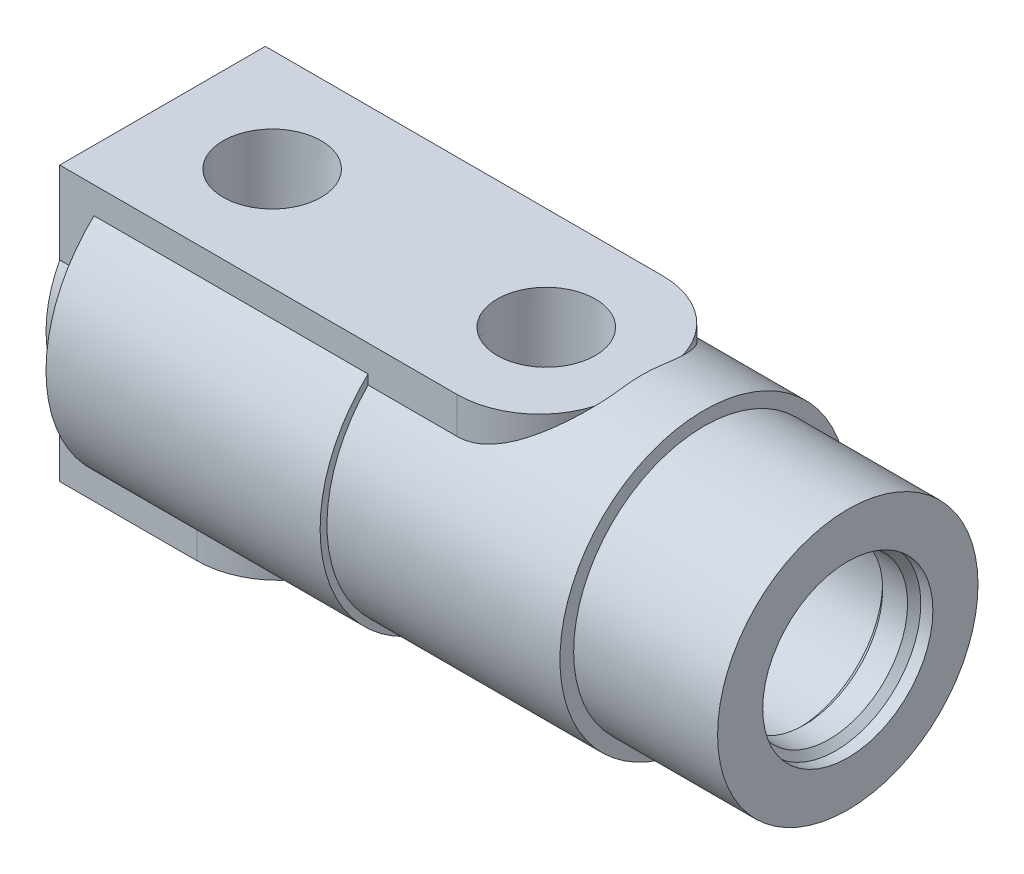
ISO-10303-21;
HEADER;
FILE_DESCRIPTION(('STEP AP214'),'2;1');
FILE_NAME('part.step','',(''),(''),'','','');
FILE_SCHEMA(('AUTOMOTIVE_DESIGN { 1 0 10303 214 1 1 1 1 }'));
ENDSEC;
DATA;
#1=APPLICATION_CONTEXT('core data for automotive mechanical design processes');
#2=APPLICATION_PROTOCOL_DEFINITION('international standard','automotive_design',2000,#1);
#3=PRODUCT_CONTEXT('',#1,'mechanical');
#4=PRODUCT('Part','Part','',(#3));
#5=PRODUCT_RELATED_PRODUCT_CATEGORY('part','',(#4));
#6=PRODUCT_DEFINITION_FORMATION('','',#4);
#7=PRODUCT_DEFINITION_CONTEXT('part definition',#1,'design');
#8=PRODUCT_DEFINITION('design','',#6,#7);
#9=PRODUCT_DEFINITION_SHAPE('','',#8);
#10=(LENGTH_UNIT() NAMED_UNIT(*) SI_UNIT(.MILLI.,.METRE.));
#11=(NAMED_UNIT(*) PLANE_ANGLE_UNIT() SI_UNIT($,.RADIAN.));
#12=(NAMED_UNIT(*) SI_UNIT($,.STERADIAN.) SOLID_ANGLE_UNIT());
#13=UNCERTAINTY_MEASURE_WITH_UNIT(LENGTH_MEASURE(1.E-05),#10,'distance_accuracy_value','');
#14=(GEOMETRIC_REPRESENTATION_CONTEXT(3) GLOBAL_UNCERTAINTY_ASSIGNED_CONTEXT((#13)) GLOBAL_UNIT_ASSIGNED_CONTEXT((#10,
#11,#12)) REPRESENTATION_CONTEXT('',''));
#15=CARTESIAN_POINT('',(0.,0.,0.));
#16=DIRECTION('',(0.,0.,1.));
#17=DIRECTION('',(1.,0.,0.));
#18=AXIS2_PLACEMENT_3D('',#15,#16,#17);
#19=CARTESIAN_POINT('',(-39.6875,0.,0.));
#20=DIRECTION('',(1.,0.,0.));
#21=DIRECTION('',(0.,0.,-1.));
#22=AXIS2_PLACEMENT_3D('',#19,#20,#21);
#23=CYLINDRICAL_SURFACE('',#22,13.49375);
#24=CARTESIAN_POINT('',(-75.409764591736,0.,0.));
#25=DIRECTION('',(1.,0.,0.));
#26=DIRECTION('',(0.,0.,-1.));
#27=AXIS2_PLACEMENT_3D('',#24,#25,#26);
#28=CIRCLE('',#27,13.49375);
#29=CARTESIAN_POINT('',(-75.409764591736,-6.34999999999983,-11.90625));
#30=VERTEX_POINT('',#29);
#31=CARTESIAN_POINT('',(-75.409764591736,6.35,-11.90625));
#32=VERTEX_POINT('',#31);
#33=EDGE_CURVE('E180',#30,#32,#28,.T.);
#34=ORIENTED_EDGE('',*,*,#33,.F.);
#35=DIRECTION('',(1.,0.,0.));
#36=VECTOR('',#35,1.);
#37=CARTESIAN_POINT('',(-39.6875,-6.34999999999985,-11.90625));
#38=LINE('',#37,#36);
#39=CARTESIAN_POINT('',(-79.375,-6.34999999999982,-11.90625));
#40=VERTEX_POINT('',#39);
#41=EDGE_CURVE('E25',#30,#40,#38,.F.);
#42=ORIENTED_EDGE('',*,*,#41,.T.);
#43=CARTESIAN_POINT('',(-79.375,0.,0.));
#44=DIRECTION('',(1.,0.,0.));
#45=DIRECTION('',(0.,0.,-1.));
#46=AXIS2_PLACEMENT_3D('',#43,#44,#45);
#47=CIRCLE('',#46,13.49375);
#48=CARTESIAN_POINT('',(-79.375,6.35,-11.90625));
#49=VERTEX_POINT('',#48);
#50=EDGE_CURVE('E11',#40,#49,#47,.T.);
#51=ORIENTED_EDGE('',*,*,#50,.T.);
#52=DIRECTION('',(1.,0.,0.));
#53=VECTOR('',#52,1.);
#54=CARTESIAN_POINT('',(-39.6875,6.35,-11.90625));
#55=LINE('',#54,#53);
#56=EDGE_CURVE('E584',#49,#32,#55,.T.);
#57=ORIENTED_EDGE('',*,*,#56,.T.);
#58=EDGE_LOOP('',(#34,#42,#51,#57));
#59=FACE_BOUND('',#58,.T.);
#60=ADVANCED_FACE('F16',(#59),#23,.T.);
#61=CARTESIAN_POINT('',(-18.5427656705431,0.,-7.91801276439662));
#62=DIRECTION('',(1.,0.,0.));
#63=DIRECTION('',(0.,0.,-1.));
#64=AXIS2_PLACEMENT_3D('',#61,#62,#63);
#65=PLANE('',#64);
#66=CARTESIAN_POINT('',(-18.5427665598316,0.,0.));
#67=DIRECTION('',(1.,0.,0.));
#68=DIRECTION('',(0.,0.,-1.));
#69=AXIS2_PLACEMENT_3D('',#66,#67,#68);
#70=CIRCLE('',#69,9.09232641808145);
#71=CARTESIAN_POINT('',(-18.5427665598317,0.,-9.09232641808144));
#72=VERTEX_POINT('',#71);
#73=EDGE_CURVE('E449',#72,#72,#70,.T.);
#74=ORIENTED_EDGE('',*,*,#73,.T.);
#75=EDGE_LOOP('',(#74));
#76=FACE_BOUND('',#75,.T.);
#77=CARTESIAN_POINT('',(-18.5427656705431,0.,0.));
#78=DIRECTION('',(1.,0.,0.));
#79=DIRECTION('',(0.,0.,-1.));
#80=AXIS2_PLACEMENT_3D('',#77,#78,#79);
#81=CIRCLE('',#80,6.7437);
#82=CARTESIAN_POINT('',(-18.5427656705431,0.,-6.74369999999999));
#83=VERTEX_POINT('',#82);
#84=EDGE_CURVE('E452',#83,#83,#81,.F.);
#85=ORIENTED_EDGE('',*,*,#84,.T.);
#86=EDGE_LOOP('',(#85));
#87=FACE_BOUND('',#86,.T.);
#88=ADVANCED_FACE('F284',(#76,#87),#65,.T.);
#89=CARTESIAN_POINT('',(-43.1799999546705,0.,-5.75945));
#90=DIRECTION('',(1.,0.,0.));
#91=DIRECTION('',(0.,0.,-1.));
#92=AXIS2_PLACEMENT_3D('',#89,#90,#91);
#93=PLANE('',#92);
#94=CARTESIAN_POINT('',(-43.1799999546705,0.,0.));
#95=DIRECTION('',(1.,0.,0.));
#96=DIRECTION('',(0.,0.,-1.));
#97=AXIS2_PLACEMENT_3D('',#94,#95,#96);
#98=CIRCLE('',#97,6.7437);
#99=CARTESIAN_POINT('',(-43.1799999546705,0.,-6.74369999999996));
#100=VERTEX_POINT('',#99);
#101=EDGE_CURVE('E462',#100,#100,#98,.T.);
#102=ORIENTED_EDGE('',*,*,#101,.T.);
#103=EDGE_LOOP('',(#102));
#104=FACE_BOUND('',#103,.T.);
#105=CARTESIAN_POINT('',(-43.1799999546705,0.,0.));
#106=DIRECTION('',(1.,0.,0.));
#107=DIRECTION('',(0.,0.,-1.));
#108=AXIS2_PLACEMENT_3D('',#105,#106,#107);
#109=CIRCLE('',#108,5.1689);
#110=CARTESIAN_POINT('',(-43.1799999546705,0.,-5.16889999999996));
#111=VERTEX_POINT('',#110);
#112=EDGE_CURVE('E20',#111,#111,#109,.F.);
#113=ORIENTED_EDGE('',*,*,#112,.T.);
#114=EDGE_LOOP('',(#113));
#115=FACE_BOUND('',#114,.T.);
#116=ADVANCED_FACE('F18',(#104,#115),#93,.T.);
#117=CARTESIAN_POINT('',(-17.7798920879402,0.,0.));
#118=DIRECTION('',(1.,0.,0.));
#119=DIRECTION('',(0.,0.,-1.));
#120=AXIS2_PLACEMENT_3D('',#117,#118,#119);
#121=CONICAL_SURFACE('',#120,9.85520088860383,0.785398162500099);
#122=CARTESIAN_POINT('',(-17.7798911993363,0.,0.));
#123=DIRECTION('',(1.,0.,0.));
#124=DIRECTION('',(0.,0.,-1.));
#125=AXIS2_PLACEMENT_3D('',#122,#123,#124);
#126=CIRCLE('',#125,9.8552);
#127=CARTESIAN_POINT('',(-17.7798911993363,0.,-9.85519999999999));
#128=VERTEX_POINT('',#127);
#129=EDGE_CURVE('E446',#128,#128,#126,.T.);
#130=ORIENTED_EDGE('',*,*,#129,.T.);
#131=EDGE_LOOP('',(#130));
#132=FACE_BOUND('',#131,.T.);
#133=ORIENTED_EDGE('',*,*,#73,.F.);
#134=EDGE_LOOP('',(#133));
#135=FACE_BOUND('',#134,.T.);
#136=ADVANCED_FACE('F419',(#132,#135),#121,.F.);
#137=CARTESIAN_POINT('',(-60.0611602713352,0.,0.));
#138=DIRECTION('',(1.,0.,0.));
#139=DIRECTION('',(0.,0.,-1.));
#140=AXIS2_PLACEMENT_3D('',#137,#138,#139);
#141=CYLINDRICAL_SURFACE('',#140,5.1689);
#142=ORIENTED_EDGE('',*,*,#112,.F.);
#143=EDGE_LOOP('',(#142));
#144=FACE_BOUND('',#143,.T.);
#145=CARTESIAN_POINT('',(-65.25879339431,0.,-5.1689));
#146=CARTESIAN_POINT('',(-65.2587970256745,-0.0931963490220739,-5.16890072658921));
#147=CARTESIAN_POINT('',(-65.2493673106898,-0.186386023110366,-5.16634409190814));
#148=CARTESIAN_POINT('',(-65.2141711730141,-0.369578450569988,-5.15649529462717));
#149=CARTESIAN_POINT('',(-65.1883293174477,-0.459564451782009,-5.14918126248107));
#150=CARTESIAN_POINT('',(-65.1308538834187,-0.619087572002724,-5.13220287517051));
#151=CARTESIAN_POINT('',(-65.1010813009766,-0.689404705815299,-5.12319234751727));
#152=CARTESIAN_POINT('',(-65.0360620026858,-0.827131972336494,-5.10276605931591));
#153=CARTESIAN_POINT('',(-65.0008103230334,-0.894539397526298,-5.09134811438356));
#154=CARTESIAN_POINT('',(-64.8892643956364,-1.0933450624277,-5.05375277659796));
#155=CARTESIAN_POINT('',(-64.8073482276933,-1.22092105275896,-5.02428025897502));
#156=CARTESIAN_POINT('',(-64.6203099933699,-1.49246416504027,-4.95110125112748));
#157=CARTESIAN_POINT('',(-64.5137360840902,-1.63493968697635,-4.90575422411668));
#158=CARTESIAN_POINT('',(-64.2964814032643,-1.91288506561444,-4.8041916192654));
#159=CARTESIAN_POINT('',(-64.1857967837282,-2.04834805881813,-4.74796563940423));
#160=CARTESIAN_POINT('',(-63.9634962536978,-2.31339337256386,-4.62461781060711));
#161=CARTESIAN_POINT('',(-63.8518804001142,-2.44297604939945,-4.55749662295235));
#162=CARTESIAN_POINT('',(-63.6297273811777,-2.69662146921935,-4.41215477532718));
#163=CARTESIAN_POINT('',(-63.519189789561,-2.82068646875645,-4.33393870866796));
#164=CARTESIAN_POINT('',(-63.3022071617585,-3.06149798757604,-4.1672388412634));
#165=CARTESIAN_POINT('',(-63.1957262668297,-3.1783235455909,-4.07891705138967));
#166=CARTESIAN_POINT('',(-62.9865835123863,-3.4059925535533,-3.89083139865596));
#167=CARTESIAN_POINT('',(-62.88392237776,-3.51683486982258,-3.79106537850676));
#168=CARTESIAN_POINT('',(-62.5839461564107,-3.83891227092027,-3.4743020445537));
#169=CARTESIAN_POINT('',(-62.3940633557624,-4.04032793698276,-3.23941256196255));
#170=CARTESIAN_POINT('',(-62.0950483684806,-4.35568810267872,-2.79255389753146));
#171=CARTESIAN_POINT('',(-61.9780663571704,-4.47845835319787,-2.59203036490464));
#172=CARTESIAN_POINT('',(-61.7672690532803,-4.69906948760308,-2.1664454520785));
#173=CARTESIAN_POINT('',(-61.6734248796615,-4.7969414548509,-1.94141517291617));
#174=CARTESIAN_POINT('',(-61.5274092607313,-4.94898169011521,-1.50656234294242));
#175=CARTESIAN_POINT('',(-61.4710546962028,-5.0075497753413,-1.29969732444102));
#176=CARTESIAN_POINT('',(-61.3831185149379,-5.09887468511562,-0.875226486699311));
#177=CARTESIAN_POINT('',(-61.3515223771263,-5.13164663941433,-0.657627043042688));
#178=CARTESIAN_POINT('',(-61.3154213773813,-5.16908761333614,-0.217006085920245));
#179=CARTESIAN_POINT('',(-61.3110074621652,-5.17366229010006,0.00603112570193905));
#180=CARTESIAN_POINT('',(-61.3298829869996,-5.15408977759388,0.449650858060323));
#181=CARTESIAN_POINT('',(-61.3531746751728,-5.12994025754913,0.670233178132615));
#182=CARTESIAN_POINT('',(-61.4237134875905,-5.05672405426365,1.09104422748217));
#183=CARTESIAN_POINT('',(-61.4696609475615,-5.00900900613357,1.29173574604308));
#184=CARTESIAN_POINT('',(-61.5819545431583,-4.89221106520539,1.6807968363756));
#185=CARTESIAN_POINT('',(-61.6483081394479,-4.82312035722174,1.86916187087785));
#186=CARTESIAN_POINT('',(-61.7747696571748,-4.69114622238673,2.17466517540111));
#187=CARTESIAN_POINT('',(-61.8304289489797,-4.63298677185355,2.29577113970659));
#188=CARTESIAN_POINT('',(-61.9487713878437,-4.50909404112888,2.53045588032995));
#189=CARTESIAN_POINT('',(-62.0114565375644,-4.44335860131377,2.64403249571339));
#190=CARTESIAN_POINT('',(-62.2087339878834,-4.23600412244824,2.97340763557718));
#191=CARTESIAN_POINT('',(-62.3524406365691,-4.08434885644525,3.17760002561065));
#192=CARTESIAN_POINT('',(-62.6081475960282,-3.81248462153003,3.49445380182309));
#193=CARTESIAN_POINT('',(-62.7156992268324,-3.69761074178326,3.61557387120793));
#194=CARTESIAN_POINT('',(-62.9367909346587,-3.45983944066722,3.84371669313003));
#195=CARTESIAN_POINT('',(-63.050331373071,-3.33694153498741,3.9507385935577));
#196=CARTESIAN_POINT('',(-63.2817108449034,-3.08405269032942,4.15117118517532));
#197=CARTESIAN_POINT('',(-63.3995542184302,-2.95405452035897,4.24456763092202));
#198=CARTESIAN_POINT('',(-63.6376453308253,-2.68765487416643,4.41806614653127));
#199=CARTESIAN_POINT('',(-63.757892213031,-2.55125565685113,4.49817286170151));
#200=CARTESIAN_POINT('',(-63.9590655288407,-2.31794968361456,4.62123820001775));
#201=CARTESIAN_POINT('',(-64.0399077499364,-2.22282020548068,4.6677457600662));
#202=CARTESIAN_POINT('',(-64.2008901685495,-2.02940054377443,4.7550313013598));
#203=CARTESIAN_POINT('',(-64.2810304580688,-1.93111078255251,4.79581004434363));
#204=CARTESIAN_POINT('',(-64.4393098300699,-1.73101761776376,4.8716055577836));
#205=CARTESIAN_POINT('',(-64.517451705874,-1.62921964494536,4.90663078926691));
#206=CARTESIAN_POINT('',(-64.6699644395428,-1.42111471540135,4.97089770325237));
#207=CARTESIAN_POINT('',(-64.7443375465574,-1.31481051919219,5.00014286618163));
#208=CARTESIAN_POINT('',(-64.8806400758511,-1.10454163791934,5.05057434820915));
#209=CARTESIAN_POINT('',(-64.9430865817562,-1.0010253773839,5.07220736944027));
#210=CARTESIAN_POINT('',(-65.0573104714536,-0.787067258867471,5.10977836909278));
#211=CARTESIAN_POINT('',(-65.1090957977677,-0.676630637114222,5.12572059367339));
#212=CARTESIAN_POINT('',(-65.1844435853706,-0.472259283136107,5.14807104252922));
#213=CARTESIAN_POINT('',(-65.2116822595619,-0.379892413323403,5.15579308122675));
#214=CARTESIAN_POINT('',(-65.2488117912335,-0.191668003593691,5.16619453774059));
#215=CARTESIAN_POINT('',(-65.2587896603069,-0.0958304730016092,5.1688992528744));
#216=CARTESIAN_POINT('',(-65.2587970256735,0.093196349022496,5.16890072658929));
#217=CARTESIAN_POINT('',(-65.2493673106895,0.186386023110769,5.16634409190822));
#218=CARTESIAN_POINT('',(-65.2141711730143,0.369578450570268,5.15649529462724));
#219=CARTESIAN_POINT('',(-65.1883293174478,0.459564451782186,5.14918126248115));
#220=CARTESIAN_POINT('',(-65.1308538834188,0.619087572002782,5.1322028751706));
#221=CARTESIAN_POINT('',(-65.1010813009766,0.689404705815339,5.12319234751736));
#222=CARTESIAN_POINT('',(-65.0360620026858,0.8271319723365,5.10276605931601));
#223=CARTESIAN_POINT('',(-65.0008103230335,0.894539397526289,5.09134811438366));
#224=CARTESIAN_POINT('',(-64.8892643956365,1.09334506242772,5.05375277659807));
#225=CARTESIAN_POINT('',(-64.8073482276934,1.22092105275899,5.02428025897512));
#226=CARTESIAN_POINT('',(-64.6203099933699,1.49246416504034,4.95110125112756));
#227=CARTESIAN_POINT('',(-64.5137360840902,1.63493968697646,4.90575422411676));
#228=CARTESIAN_POINT('',(-64.2964814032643,1.91288506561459,4.80419161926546));
#229=CARTESIAN_POINT('',(-64.1857967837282,2.04834805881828,4.74796563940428));
#230=CARTESIAN_POINT('',(-63.9634962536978,2.313393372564,4.62461781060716));
#231=CARTESIAN_POINT('',(-63.8518804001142,2.44297604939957,4.55749662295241));
#232=CARTESIAN_POINT('',(-63.6297273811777,2.69662146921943,4.41215477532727));
#233=CARTESIAN_POINT('',(-63.519189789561,2.8206864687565,4.33393870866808));
#234=CARTESIAN_POINT('',(-63.3022071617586,3.06149798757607,4.16723884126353));
#235=CARTESIAN_POINT('',(-63.1957262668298,3.17832354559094,4.07891705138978));
#236=CARTESIAN_POINT('',(-62.9865835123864,3.40599255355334,3.89083139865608));
#237=CARTESIAN_POINT('',(-62.8839223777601,3.51683486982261,3.7910653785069));
#238=CARTESIAN_POINT('',(-62.5839461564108,3.8389122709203,3.47430204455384));
#239=CARTESIAN_POINT('',(-62.3940633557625,4.04032793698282,3.23941256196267));
#240=CARTESIAN_POINT('',(-62.0950483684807,4.35568810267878,2.79255389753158));
#241=CARTESIAN_POINT('',(-61.9780663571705,4.47845835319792,2.59203036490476));
#242=CARTESIAN_POINT('',(-61.7672690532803,4.69906948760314,2.16644545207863));
#243=CARTESIAN_POINT('',(-61.6734248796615,4.79694145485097,1.94141517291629));
#244=CARTESIAN_POINT('',(-61.5274092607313,4.94898169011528,1.50656234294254));
#245=CARTESIAN_POINT('',(-61.4710546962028,5.00754977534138,1.29969732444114));
#246=CARTESIAN_POINT('',(-61.3831185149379,5.0988746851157,0.875226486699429));
#247=CARTESIAN_POINT('',(-61.3515223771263,5.13164663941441,0.657627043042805));
#248=CARTESIAN_POINT('',(-61.3154213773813,5.16908761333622,0.217006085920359));
#249=CARTESIAN_POINT('',(-61.3110074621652,5.17366229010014,-0.00603112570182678));
#250=CARTESIAN_POINT('',(-61.3298829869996,5.15408977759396,-0.449650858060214));
#251=CARTESIAN_POINT('',(-61.3531746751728,5.12994025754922,-0.670233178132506));
#252=CARTESIAN_POINT('',(-61.4237134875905,5.05672405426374,-1.09104422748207));
#253=CARTESIAN_POINT('',(-61.4696609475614,5.00900900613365,-1.29173574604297));
#254=CARTESIAN_POINT('',(-61.5819545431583,4.89221106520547,-1.68079683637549));
#255=CARTESIAN_POINT('',(-61.6483081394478,4.82312035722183,-1.86916187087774));
#256=CARTESIAN_POINT('',(-61.7747696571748,4.69114622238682,-2.17466517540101));
#257=CARTESIAN_POINT('',(-61.8304289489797,4.63298677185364,-2.29577113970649));
#258=CARTESIAN_POINT('',(-61.9487713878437,4.50909404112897,-2.53045588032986));
#259=CARTESIAN_POINT('',(-62.0114565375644,4.44335860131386,-2.64403249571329));
#260=CARTESIAN_POINT('',(-62.2087339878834,4.23600412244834,-2.97340763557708));
#261=CARTESIAN_POINT('',(-62.3524406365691,4.08434885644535,-3.17760002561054));
#262=CARTESIAN_POINT('',(-62.6081475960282,3.81248462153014,-3.49445380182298));
#263=CARTESIAN_POINT('',(-62.7156992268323,3.69761074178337,-3.61557387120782));
#264=CARTESIAN_POINT('',(-62.9367909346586,3.45983944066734,-3.84371669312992));
#265=CARTESIAN_POINT('',(-63.050331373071,3.33694153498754,-3.95073859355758));
#266=CARTESIAN_POINT('',(-63.2817108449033,3.08405269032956,-4.15117118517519));
#267=CARTESIAN_POINT('',(-63.3995542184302,2.95405452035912,-4.24456763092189));
#268=CARTESIAN_POINT('',(-63.6376453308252,2.68765487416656,-4.41806614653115));
#269=CARTESIAN_POINT('',(-63.7578922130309,2.55125565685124,-4.49817286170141));
#270=CARTESIAN_POINT('',(-63.9590655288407,2.31794968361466,-4.62123820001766));
#271=CARTESIAN_POINT('',(-64.0399077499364,2.22282020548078,-4.66774576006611));
#272=CARTESIAN_POINT('',(-64.2008901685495,2.02940054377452,-4.75503130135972));
#273=CARTESIAN_POINT('',(-64.2810304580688,1.93111078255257,-4.79581004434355));
#274=CARTESIAN_POINT('',(-64.43930983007,1.7310176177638,-4.87160555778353));
#275=CARTESIAN_POINT('',(-64.517451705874,1.6292196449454,-4.90663078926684));
#276=CARTESIAN_POINT('',(-64.6699644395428,1.4211147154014,-4.97089770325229));
#277=CARTESIAN_POINT('',(-64.7443375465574,1.31481051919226,-5.00014286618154));
#278=CARTESIAN_POINT('',(-64.8806400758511,1.10454163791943,-5.05057434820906));
#279=CARTESIAN_POINT('',(-64.9430865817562,1.00102537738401,-5.07220736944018));
#280=CARTESIAN_POINT('',(-65.0573104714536,0.787067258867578,-5.10977836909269));
#281=CARTESIAN_POINT('',(-65.1090957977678,0.676630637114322,-5.1257205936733));
#282=CARTESIAN_POINT('',(-65.1844435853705,0.472259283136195,-5.14807104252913));
#283=CARTESIAN_POINT('',(-65.2116822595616,0.379892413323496,-5.15579308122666));
#284=CARTESIAN_POINT('',(-65.2488117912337,0.191668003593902,-5.1661945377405));
#285=CARTESIAN_POINT('',(-65.2587896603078,0.0958304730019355,-5.1688992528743));
#286=CARTESIAN_POINT('',(-65.25879339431,0.,-5.1689));
#287=B_SPLINE_CURVE_WITH_KNOTS('',3,(#145,#146,#147,#148,#149,#150,#151,#152,#153,#154,#155,
#156,#157,#158,#159,#160,#161,#162,#163,#164,#165,#166,#167,#168,#169,#170,#171,#172,#173,#174,
#175,#176,#177,#178,#179,#180,#181,#182,#183,#184,#185,#186,#187,#188,#189,#190,#191,#192,#193,
#194,#195,#196,#197,#198,#199,#200,#201,#202,#203,#204,#205,#206,#207,#208,#209,#210,#211,#212,
#213,#214,#215,#216,#217,#218,#219,#220,#221,#222,#223,#224,#225,#226,#227,#228,#229,#230,#231,
#232,#233,#234,#235,#236,#237,#238,#239,#240,#241,#242,#243,#244,#245,#246,#247,#248,#249,#250,
#251,#252,#253,#254,#255,#256,#257,#258,#259,#260,#261,#262,#263,#264,#265,#266,#267,#268,#269,
#270,#271,#272,#273,#274,#275,#276,#277,#278,#279,#280,#281,#282,#283,#284,#285,#286),
.UNSPECIFIED.,.T.,.F.,(4,2,2,2,2,2,2,2,2,2,2,2,2,2,2,2,2,2,2,2,2,2,2,2,2,2,2,2,2,2,2,2,2,2,2,2,
2,2,2,2,2,2,2,2,2,2,2,2,2,2,2,2,2,2,2,2,2,2,2,2,2,2,2,2,2,2,2,2,2,2,4),(0.,0.279178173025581,
0.559648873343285,0.789984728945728,1.02053048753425,1.48293531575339,2.03320313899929,
2.58399972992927,3.13476290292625,3.685298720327,4.22799764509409,4.77079903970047,
5.85356837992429,6.63872684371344,7.42290024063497,8.08685307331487,8.75041619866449,
9.41619828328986,10.0820343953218,10.7134742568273,11.3451452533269,11.7808497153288,
12.2166786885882,13.0892121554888,13.6842930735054,14.2794099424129,14.8751446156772,
15.4706706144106,15.8701938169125,16.2696638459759,16.6685410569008,17.0671773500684,
17.4351672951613,17.8028820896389,18.0914097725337,18.3784787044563,18.6576568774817,
18.9381275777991,19.1684634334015,19.3990091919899,19.8614140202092,20.4116818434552,
20.9624784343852,21.5132416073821,22.0637774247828,22.6064763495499,23.1492777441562,
24.23204708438,25.0172055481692,25.8013789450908,26.4653317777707,27.1288949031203,
27.7946769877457,28.4605130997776,29.0919529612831,29.7236239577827,30.1593284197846,
30.595157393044,31.4676908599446,32.0627717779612,32.6578886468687,33.253623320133,
33.8491493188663,34.2486725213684,34.6481425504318,35.0470197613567,35.4456560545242,
35.8136459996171,36.1813607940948,36.4698884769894,36.7569574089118),.UNSPECIFIED.);
#288=CARTESIAN_POINT('',(-65.25879339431,0.,-5.1689));
#289=VERTEX_POINT('',#288);
#290=EDGE_CURVE('E402',#289,#289,#287,.T.);
#291=ORIENTED_EDGE('',*,*,#290,.T.);
#292=EDGE_LOOP('',(#291));
#293=FACE_BOUND('',#292,.T.);
#294=ADVANCED_FACE('F414',(#144,#293),#141,.F.);
#295=CARTESIAN_POINT('',(-29.4710531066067,0.,0.));
#296=DIRECTION('',(1.,0.,0.));
#297=DIRECTION('',(0.,0.,-1.));
#298=AXIS2_PLACEMENT_3D('',#295,#296,#297);
#299=CYLINDRICAL_SURFACE('',#298,6.7437);
#300=ORIENTED_EDGE('',*,*,#101,.F.);
#301=EDGE_LOOP('',(#300));
#302=FACE_BOUND('',#301,.T.);
#303=CARTESIAN_POINT('',(-34.925,4.09320428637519,-5.3594));
#304=CARTESIAN_POINT('',(-35.0266227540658,4.09320349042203,-5.35940030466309));
#305=CARTESIAN_POINT('',(-35.128238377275,4.09700799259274,-5.35650221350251));
#306=CARTESIAN_POINT('',(-35.3306112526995,4.1120104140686,-5.34499186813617));
#307=CARTESIAN_POINT('',(-35.4313682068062,4.12321080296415,-5.3363777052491));
#308=CARTESIAN_POINT('',(-35.7314410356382,4.16721199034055,-5.30219712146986));
#309=CARTESIAN_POINT('',(-35.9283432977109,4.21041108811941,-5.26829321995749));
#310=CARTESIAN_POINT('',(-36.37731531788,4.33612624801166,-5.1656463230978));
#311=CARTESIAN_POINT('',(-36.6251146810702,4.42704902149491,-5.08893830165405));
#312=CARTESIAN_POINT('',(-36.9808401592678,4.57922628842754,-4.95105543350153));
#313=CARTESIAN_POINT('',(-37.096945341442,4.63269352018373,-4.90118181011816));
#314=CARTESIAN_POINT('',(-37.3239484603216,4.74335871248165,-4.79415744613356));
#315=CARTESIAN_POINT('',(-37.4348464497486,4.80055663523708,-4.73700677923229));
#316=CARTESIAN_POINT('',(-37.6894052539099,4.93771743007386,-4.59449056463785));
#317=CARTESIAN_POINT('',(-37.830941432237,5.01863873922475,-4.50625250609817));
#318=CARTESIAN_POINT('',(-38.1046863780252,5.18195688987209,-4.31745462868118));
#319=CARTESIAN_POINT('',(-38.2368918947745,5.26435423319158,-4.21689054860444));
#320=CARTESIAN_POINT('',(-38.4916410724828,5.4282367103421,-4.00372121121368));
#321=CARTESIAN_POINT('',(-38.6141922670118,5.50972251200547,-3.89112550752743));
#322=CARTESIAN_POINT('',(-38.8491490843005,5.6697341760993,-3.65405221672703));
#323=CARTESIAN_POINT('',(-38.9615580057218,5.74826099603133,-3.52957852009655));
#324=CARTESIAN_POINT('',(-39.2407464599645,5.94687177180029,-3.18921139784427));
#325=CARTESIAN_POINT('',(-39.398989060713,6.0631672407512,-2.9637778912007));
#326=CARTESIAN_POINT('',(-39.611155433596,6.22191455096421,-2.60432242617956));
#327=CARTESIAN_POINT('',(-39.6776695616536,6.27220771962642,-2.48097396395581));
#328=CARTESIAN_POINT('',(-39.80158283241,6.36661291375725,-2.22754722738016));
#329=CARTESIAN_POINT('',(-39.8589875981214,6.41072875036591,-2.09747317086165));
#330=CARTESIAN_POINT('',(-39.9554961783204,6.48532461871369,-1.85249580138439));
#331=CARTESIAN_POINT('',(-39.9960586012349,6.51685719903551,-1.7384845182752));
#332=CARTESIAN_POINT('',(-40.0696771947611,6.57430559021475,-1.50672974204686));
#333=CARTESIAN_POINT('',(-40.1027369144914,6.60022405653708,-1.38898804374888));
#334=CARTESIAN_POINT('',(-40.1609192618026,6.64596483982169,-1.15038953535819));
#335=CARTESIAN_POINT('',(-40.1860417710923,6.66578706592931,-1.02953267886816));
#336=CARTESIAN_POINT('',(-40.2279612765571,6.69892189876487,-0.785546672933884));
#337=CARTESIAN_POINT('',(-40.2447615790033,6.71223709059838,-0.662418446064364));
#338=CARTESIAN_POINT('',(-40.2698225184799,6.73211634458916,-0.414298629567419));
#339=CARTESIAN_POINT('',(-40.2780521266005,6.73865587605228,-0.289301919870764));
#340=CARTESIAN_POINT('',(-40.2857230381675,6.74475109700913,-0.0388674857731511));
#341=CARTESIAN_POINT('',(-40.2851643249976,6.74430677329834,0.0865702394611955));
#342=CARTESIAN_POINT('',(-40.2752680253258,6.73644418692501,0.336882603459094));
#343=CARTESIAN_POINT('',(-40.2659300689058,6.72902563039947,0.461757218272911));
#344=CARTESIAN_POINT('',(-40.2386351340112,6.70738181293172,0.709956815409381));
#345=CARTESIAN_POINT('',(-40.2206783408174,6.69315669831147,0.833281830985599));
#346=CARTESIAN_POINT('',(-40.1776085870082,6.65913306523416,1.07101847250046));
#347=CARTESIAN_POINT('',(-40.1529248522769,6.639669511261,1.1855563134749));
#348=CARTESIAN_POINT('',(-40.0964239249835,6.59527439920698,1.41179203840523));
#349=CARTESIAN_POINT('',(-40.0646043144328,6.57034098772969,1.52348894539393));
#350=CARTESIAN_POINT('',(-39.9590230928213,6.48796947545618,1.85337410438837));
#351=CARTESIAN_POINT('',(-39.8751084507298,6.42293557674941,2.06652200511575));
#352=CARTESIAN_POINT('',(-39.6743274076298,6.26943624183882,2.49572804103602));
#353=CARTESIAN_POINT('',(-39.5550420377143,6.17930194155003,2.71003460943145));
#354=CARTESIAN_POINT('',(-39.2921555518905,5.98486057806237,3.11603688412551));
#355=CARTESIAN_POINT('',(-39.148539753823,5.8805449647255,3.30771881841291));
#356=CARTESIAN_POINT('',(-38.8083727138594,5.64068517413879,3.70463011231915));
#357=CARTESIAN_POINT('',(-38.6070084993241,5.50312943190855,3.90454516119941));
#358=CARTESIAN_POINT('',(-38.2844037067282,5.29464346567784,4.17821564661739));
#359=CARTESIAN_POINT('',(-38.1733386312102,5.22472874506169,4.26513517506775));
#360=CARTESIAN_POINT('',(-37.9444096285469,5.08555512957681,4.43015120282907));
#361=CARTESIAN_POINT('',(-37.8265465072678,5.01629615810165,4.50824874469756));
#362=CARTESIAN_POINT('',(-37.5974738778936,4.88758509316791,4.64725320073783));
#363=CARTESIAN_POINT('',(-37.4869701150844,4.82789552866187,4.70910608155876));
#364=CARTESIAN_POINT('',(-37.2605250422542,4.71164031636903,4.82542141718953));
#365=CARTESIAN_POINT('',(-37.1445834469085,4.65507483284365,4.87988348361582));
#366=CARTESIAN_POINT('',(-36.9073363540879,4.546741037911,4.9809756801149));
#367=CARTESIAN_POINT('',(-36.7860372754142,4.49496720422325,5.02761487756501));
#368=CARTESIAN_POINT('',(-36.5379283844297,4.3980481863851,5.11261372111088));
#369=CARTESIAN_POINT('',(-36.4111177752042,4.35290396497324,5.15097216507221));
#370=CARTESIAN_POINT('',(-36.1739848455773,4.27829793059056,5.21302267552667));
#371=CARTESIAN_POINT('',(-36.0644545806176,4.24747597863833,5.23809488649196));
#372=CARTESIAN_POINT('',(-35.8423048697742,4.19335009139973,5.28152554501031));
#373=CARTESIAN_POINT('',(-35.7296878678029,4.17004038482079,5.29988914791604));
#374=CARTESIAN_POINT('',(-35.5023662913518,4.13220984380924,5.32943820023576));
#375=CARTESIAN_POINT('',(-35.3876685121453,4.11766436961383,5.34064377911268));
#376=CARTESIAN_POINT('',(-35.156977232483,4.09816291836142,5.35562382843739));
#377=CARTESIAN_POINT('',(-35.040983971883,4.09320519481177,5.35939965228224));
#378=CARTESIAN_POINT('',(-34.8233772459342,4.09320349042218,5.3594003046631));
#379=CARTESIAN_POINT('',(-34.7217616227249,4.09700799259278,5.35650221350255));
#380=CARTESIAN_POINT('',(-34.5193887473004,4.11201041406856,5.34499186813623));
#381=CARTESIAN_POINT('',(-34.4186317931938,4.12321080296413,5.33637770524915));
#382=CARTESIAN_POINT('',(-34.1185589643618,4.16721199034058,5.3021971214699));
#383=CARTESIAN_POINT('',(-33.9216567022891,4.21041108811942,5.26829321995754));
#384=CARTESIAN_POINT('',(-33.47268468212,4.33612624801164,5.16564632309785));
#385=CARTESIAN_POINT('',(-33.2248853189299,4.42704902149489,5.0889383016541));
#386=CARTESIAN_POINT('',(-32.8691598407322,4.57922628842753,4.95105543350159));
#387=CARTESIAN_POINT('',(-32.7530546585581,4.63269352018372,4.90118181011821));
#388=CARTESIAN_POINT('',(-32.5260515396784,4.74335871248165,4.79415744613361));
#389=CARTESIAN_POINT('',(-32.4151535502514,4.80055663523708,4.73700677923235));
#390=CARTESIAN_POINT('',(-32.1605947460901,4.93771743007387,4.5944905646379));
#391=CARTESIAN_POINT('',(-32.019058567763,5.01863873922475,4.50625250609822));
#392=CARTESIAN_POINT('',(-31.7453136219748,5.18195688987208,4.31745462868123));
#393=CARTESIAN_POINT('',(-31.6131081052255,5.26435423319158,4.21689054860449));
#394=CARTESIAN_POINT('',(-31.3583589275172,5.42823671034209,4.00372121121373));
#395=CARTESIAN_POINT('',(-31.2358077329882,5.50972251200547,3.89112550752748));
#396=CARTESIAN_POINT('',(-31.0008509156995,5.66973417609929,3.65405221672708));
#397=CARTESIAN_POINT('',(-30.8884419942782,5.74826099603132,3.52957852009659));
#398=CARTESIAN_POINT('',(-30.6092535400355,5.94687177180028,3.18921139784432));
#399=CARTESIAN_POINT('',(-30.451010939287,6.06316724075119,2.96377789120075));
#400=CARTESIAN_POINT('',(-30.238844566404,6.22191455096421,2.60432242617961));
#401=CARTESIAN_POINT('',(-30.1723304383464,6.27220771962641,2.48097396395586));
#402=CARTESIAN_POINT('',(-30.04841716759,6.36661291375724,2.22754722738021));
#403=CARTESIAN_POINT('',(-29.9910124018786,6.41072875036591,2.0974731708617));
#404=CARTESIAN_POINT('',(-29.8945038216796,6.48532461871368,1.85249580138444));
#405=CARTESIAN_POINT('',(-29.8539413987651,6.5168571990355,1.73848451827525));
#406=CARTESIAN_POINT('',(-29.7803228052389,6.57430559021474,1.50672974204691));
#407=CARTESIAN_POINT('',(-29.7472630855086,6.60022405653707,1.38898804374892));
#408=CARTESIAN_POINT('',(-29.6890807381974,6.64596483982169,1.15038953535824));
#409=CARTESIAN_POINT('',(-29.6639582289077,6.6657870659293,1.0295326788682));
#410=CARTESIAN_POINT('',(-29.6220387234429,6.69892189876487,0.785546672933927));
#411=CARTESIAN_POINT('',(-29.6052384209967,6.71223709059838,0.662418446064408));
#412=CARTESIAN_POINT('',(-29.5801774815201,6.73211634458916,0.414298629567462));
#413=CARTESIAN_POINT('',(-29.5719478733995,6.73865587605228,0.289301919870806));
#414=CARTESIAN_POINT('',(-29.5642769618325,6.74475109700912,0.038867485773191));
#415=CARTESIAN_POINT('',(-29.5648356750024,6.74430677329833,-0.0865702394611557));
#416=CARTESIAN_POINT('',(-29.5747319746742,6.73644418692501,-0.336882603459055));
#417=CARTESIAN_POINT('',(-29.5840699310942,6.72902563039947,-0.461757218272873));
#418=CARTESIAN_POINT('',(-29.6113648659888,6.70738181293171,-0.709956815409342));
#419=CARTESIAN_POINT('',(-29.6293216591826,6.69315669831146,-0.833281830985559));
#420=CARTESIAN_POINT('',(-29.6723914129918,6.65913306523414,-1.07101847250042));
#421=CARTESIAN_POINT('',(-29.6970751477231,6.63966951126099,-1.18555631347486));
#422=CARTESIAN_POINT('',(-29.7535760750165,6.59527439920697,-1.41179203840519));
#423=CARTESIAN_POINT('',(-29.7853956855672,6.57034098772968,-1.5234889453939));
#424=CARTESIAN_POINT('',(-29.8909769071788,6.48796947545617,-1.85337410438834));
#425=CARTESIAN_POINT('',(-29.9748915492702,6.4229355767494,-2.06652200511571));
#426=CARTESIAN_POINT('',(-30.1756725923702,6.26943624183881,-2.49572804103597));
#427=CARTESIAN_POINT('',(-30.2949579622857,6.17930194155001,-2.71003460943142));
#428=CARTESIAN_POINT('',(-30.5578444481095,5.98486057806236,-3.11603688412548));
#429=CARTESIAN_POINT('',(-30.701460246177,5.88054496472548,-3.30771881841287));
#430=CARTESIAN_POINT('',(-31.0416272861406,5.64068517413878,-3.7046301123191));
#431=CARTESIAN_POINT('',(-31.2429915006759,5.50312943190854,-3.90454516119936));
#432=CARTESIAN_POINT('',(-31.5655962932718,5.29464346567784,-4.17821564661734));
#433=CARTESIAN_POINT('',(-31.6766613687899,5.22472874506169,-4.26513517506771));
#434=CARTESIAN_POINT('',(-31.9055903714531,5.08555512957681,-4.43015120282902));
#435=CARTESIAN_POINT('',(-32.0234534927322,5.01629615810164,-4.50824874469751));
#436=CARTESIAN_POINT('',(-32.2525261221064,4.8875850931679,-4.64725320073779));
#437=CARTESIAN_POINT('',(-32.3630298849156,4.82789552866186,-4.70910608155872));
#438=CARTESIAN_POINT('',(-32.5894749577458,4.71164031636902,-4.82542141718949));
#439=CARTESIAN_POINT('',(-32.7054165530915,4.65507483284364,-4.87988348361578));
#440=CARTESIAN_POINT('',(-32.9426636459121,4.54674103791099,-4.98097568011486));
#441=CARTESIAN_POINT('',(-33.0639627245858,4.49496720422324,-5.02761487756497));
#442=CARTESIAN_POINT('',(-33.3120716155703,4.39804818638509,-5.11261372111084));
#443=CARTESIAN_POINT('',(-33.4388822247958,4.35290396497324,-5.15097216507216));
#444=CARTESIAN_POINT('',(-33.6760151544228,4.27829793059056,-5.21302267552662));
#445=CARTESIAN_POINT('',(-33.7855454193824,4.24747597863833,-5.23809488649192));
#446=CARTESIAN_POINT('',(-34.0076951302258,4.19335009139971,-5.28152554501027));
#447=CARTESIAN_POINT('',(-34.1203121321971,4.17004038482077,-5.29988914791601));
#448=CARTESIAN_POINT('',(-34.3476337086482,4.13220984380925,-5.32943820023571));
#449=CARTESIAN_POINT('',(-34.4623314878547,4.11766436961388,-5.34064377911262));
#450=CARTESIAN_POINT('',(-34.693022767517,4.09816291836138,-5.35562382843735));
#451=CARTESIAN_POINT('',(-34.809016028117,4.0932051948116,-5.35939965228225));
#452=CARTESIAN_POINT('',(-34.925,4.09320428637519,-5.3594));
#453=B_SPLINE_CURVE_WITH_KNOTS('',3,(#303,#304,#305,#306,#307,#308,#309,#310,#311,#312,#313,
#314,#315,#316,#317,#318,#319,#320,#321,#322,#323,#324,#325,#326,#327,#328,#329,#330,#331,#332,
#333,#334,#335,#336,#337,#338,#339,#340,#341,#342,#343,#344,#345,#346,#347,#348,#349,#350,#351,
#352,#353,#354,#355,#356,#357,#358,#359,#360,#361,#362,#363,#364,#365,#366,#367,#368,#369,#370,
#371,#372,#373,#374,#375,#376,#377,#378,#379,#380,#381,#382,#383,#384,#385,#386,#387,#388,#389,
#390,#391,#392,#393,#394,#395,#396,#397,#398,#399,#400,#401,#402,#403,#404,#405,#406,#407,#408,
#409,#410,#411,#412,#413,#414,#415,#416,#417,#418,#419,#420,#421,#422,#423,#424,#425,#426,#427,
#428,#429,#430,#431,#432,#433,#434,#435,#436,#437,#438,#439,#440,#441,#442,#443,#444,#445,#446,
#447,#448,#449,#450,#451,#452),.UNSPECIFIED.,.T.,.F.,(4,2,2,2,2,2,2,2,2,2,2,2,2,2,2,2,2,2,2,2,2,
2,2,2,2,2,2,2,2,2,2,2,2,2,2,2,2,2,2,2,2,2,2,2,2,2,2,2,2,2,2,2,2,2,2,2,2,2,2,2,2,2,2,2,2,2,2,2,2,
2,2,2,2,2,4),(0.,0.30474055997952,0.609582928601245,1.21990467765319,2.03977658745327,
2.45117927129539,2.86257778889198,3.41802648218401,3.97366774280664,4.52887103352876,
5.0838930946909,5.97664301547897,6.42287883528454,6.86883812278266,7.24362208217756,
7.61822838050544,7.99284026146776,8.3673031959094,8.74311715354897,9.11893182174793,
9.49476232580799,9.87058475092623,10.2265089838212,10.5825540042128,11.2941401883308,
12.075272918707,12.8568787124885,13.7991467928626,14.2710881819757,14.7429737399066,
15.162671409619,15.5823911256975,16.0016209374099,16.4209115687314,16.7700353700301,
17.1188903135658,17.4667598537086,17.8145660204,18.1193065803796,18.4241489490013,
19.0344706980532,19.8543426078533,20.2657452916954,20.677143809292,21.232592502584,
21.7882337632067,22.3434370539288,22.8984591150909,23.791209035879,24.2374448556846,
24.6834041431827,25.0581881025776,25.4327944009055,25.8074062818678,26.1818692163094,
26.557683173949,26.933497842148,27.309328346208,27.6851507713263,28.0410750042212,
28.3971200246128,29.1087062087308,29.889838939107,30.6714447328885,31.6137128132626,
32.0856542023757,32.5575397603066,32.977237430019,33.3969571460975,33.8161869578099,
34.2354775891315,34.5846013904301,34.9334563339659,35.2813258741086,35.6291320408),.UNSPECIFIED.);
#454=CARTESIAN_POINT('',(-34.925,4.09320428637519,-5.3594));
#455=VERTEX_POINT('',#454);
#456=EDGE_CURVE('E394',#455,#455,#453,.T.);
#457=ORIENTED_EDGE('',*,*,#456,.T.);
#458=EDGE_LOOP('',(#457));
#459=FACE_BOUND('',#458,.T.);
#460=ORIENTED_EDGE('',*,*,#84,.F.);
#461=EDGE_LOOP('',(#460));
#462=FACE_BOUND('',#461,.T.);
#463=ADVANCED_FACE('F410',(#302,#459,#462),#299,.F.);
#464=CARTESIAN_POINT('',(-11.7958906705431,0.,0.));
#465=DIRECTION('',(1.,0.,0.));
#466=DIRECTION('',(0.,0.,-1.));
#467=AXIS2_PLACEMENT_3D('',#464,#465,#466);
#468=CYLINDRICAL_SURFACE('',#467,9.8552);
#469=CARTESIAN_POINT('',(-5.81188925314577,0.,0.));
#470=DIRECTION('',(-1.,0.,0.));
#471=DIRECTION('',(0.,-1.,0.));
#472=AXIS2_PLACEMENT_3D('',#469,#470,#471);
#473=CIRCLE('',#472,9.85520088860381);
#474=CARTESIAN_POINT('',(-5.81188925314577,-9.85520088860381,0.));
#475=VERTEX_POINT('',#474);
#476=EDGE_CURVE('E401',#475,#475,#473,.F.);
#477=ORIENTED_EDGE('',*,*,#476,.T.);
#478=EDGE_LOOP('',(#477));
#479=FACE_BOUND('',#478,.T.);
#480=ORIENTED_EDGE('',*,*,#129,.F.);
#481=EDGE_LOOP('',(#480));
#482=FACE_BOUND('',#481,.T.);
#483=ADVANCED_FACE('F413',(#479,#482),#468,.F.);
#484=CARTESIAN_POINT('',(-66.675,7.2644,0.));
#485=DIRECTION('',(0.,-1.,0.));
#486=DIRECTION('',(0.,0.,-1.));
#487=AXIS2_PLACEMENT_3D('',#484,#485,#486);
#488=CYLINDRICAL_SURFACE('',#487,5.3594);
#489=CARTESIAN_POINT('',(-66.675,-7.2644,0.));
#490=DIRECTION('',(0.,-1.,0.));
#491=DIRECTION('',(0.,0.,-1.));
#492=AXIS2_PLACEMENT_3D('',#489,#490,#491);
#493=CIRCLE('',#492,5.3594);
#494=CARTESIAN_POINT('',(-66.675,-7.2644,-5.35939999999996));
#495=VERTEX_POINT('',#494);
#496=EDGE_CURVE('E403',#495,#495,#493,.T.);
#497=ORIENTED_EDGE('',*,*,#496,.T.);
#498=EDGE_LOOP('',(#497));
#499=FACE_BOUND('',#498,.T.);
#500=CARTESIAN_POINT('',(-66.675,7.2644,0.));
#501=DIRECTION('',(0.,-1.,0.));
#502=DIRECTION('',(0.,0.,-1.));
#503=AXIS2_PLACEMENT_3D('',#500,#501,#502);
#504=CIRCLE('',#503,5.3594);
#505=CARTESIAN_POINT('',(-66.675,7.2644,-5.35939999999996));
#506=VERTEX_POINT('',#505);
#507=EDGE_CURVE('E479',#506,#506,#504,.F.);
#508=ORIENTED_EDGE('',*,*,#507,.T.);
#509=EDGE_LOOP('',(#508));
#510=FACE_BOUND('',#509,.T.);
#511=ORIENTED_EDGE('',*,*,#290,.F.);
#512=EDGE_LOOP('',(#511));
#513=FACE_BOUND('',#512,.T.);
#514=ADVANCED_FACE('F389',(#499,#510,#513),#488,.F.);
#515=CARTESIAN_POINT('',(-34.925,7.2644,0.));
#516=DIRECTION('',(0.,-1.,0.));
#517=DIRECTION('',(0.,0.,-1.));
#518=AXIS2_PLACEMENT_3D('',#515,#516,#517);
#519=CYLINDRICAL_SURFACE('',#518,5.3594);
#520=ORIENTED_EDGE('',*,*,#456,.F.);
#521=EDGE_LOOP('',(#520));
#522=FACE_BOUND('',#521,.T.);
#523=CARTESIAN_POINT('',(-34.925,7.2644,0.));
#524=DIRECTION('',(0.,-1.,0.));
#525=DIRECTION('',(0.,0.,-1.));
#526=AXIS2_PLACEMENT_3D('',#523,#524,#525);
#527=CIRCLE('',#526,5.3594);
#528=CARTESIAN_POINT('',(-34.925,7.2644,-5.35939999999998));
#529=VERTEX_POINT('',#528);
#530=EDGE_CURVE('E481',#529,#529,#527,.F.);
#531=ORIENTED_EDGE('',*,*,#530,.T.);
#532=EDGE_LOOP('',(#531));
#533=FACE_BOUND('',#532,.T.);
#534=ADVANCED_FACE('F385',(#522,#533),#519,.F.);
#535=CARTESIAN_POINT('',(-5.81188925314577,0.,0.));
#536=DIRECTION('',(-1.,0.,0.));
#537=DIRECTION('',(0.,0.,1.));
#538=AXIS2_PLACEMENT_3D('',#535,#536,#537);
#539=CONICAL_SURFACE('',#538,9.85520088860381,0.785398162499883);
#540=CARTESIAN_POINT('',(-5.04901567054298,0.,0.));
#541=DIRECTION('',(1.,0.,0.));
#542=DIRECTION('',(0.,0.,-1.));
#543=AXIS2_PLACEMENT_3D('',#540,#541,#542);
#544=CIRCLE('',#543,9.09232552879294);
#545=CARTESIAN_POINT('',(-5.04901567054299,0.,-9.09232552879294));
#546=VERTEX_POINT('',#545);
#547=EDGE_CURVE('E483',#546,#546,#544,.T.);
#548=ORIENTED_EDGE('',*,*,#547,.T.);
#549=EDGE_LOOP('',(#548));
#550=FACE_BOUND('',#549,.T.);
#551=ORIENTED_EDGE('',*,*,#476,.F.);
#552=EDGE_LOOP('',(#551));
#553=FACE_BOUND('',#552,.T.);
#554=ADVANCED_FACE('F383',(#550,#553),#539,.F.);
#555=CARTESIAN_POINT('',(-72.193404,-7.2644,5.518404));
#556=DIRECTION('',(0.,1.,0.));
#557=DIRECTION('',(0.,0.,1.));
#558=AXIS2_PLACEMENT_3D('',#555,#556,#557);
#559=PLANE('',#558);
#560=CARTESIAN_POINT('',(-66.675,-7.26439999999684,0.));
#561=DIRECTION('',(0.,-1.,0.));
#562=DIRECTION('',(0.,0.,-1.));
#563=AXIS2_PLACEMENT_3D('',#560,#561,#562);
#564=CIRCLE('',#563,5.41020000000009);
#565=CARTESIAN_POINT('',(-66.675,-7.26439999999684,-5.41020000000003));
#566=VERTEX_POINT('',#565);
#567=EDGE_CURVE('E486',#566,#566,#564,.T.);
#568=ORIENTED_EDGE('',*,*,#567,.T.);
#569=EDGE_LOOP('',(#568));
#570=FACE_BOUND('',#569,.T.);
#571=ORIENTED_EDGE('',*,*,#496,.F.);
#572=EDGE_LOOP('',(#571));
#573=FACE_BOUND('',#572,.T.);
#574=ADVANCED_FACE('F379',(#570,#573),#559,.F.);
#575=CARTESIAN_POINT('',(-61.156596,7.2644,5.518404));
#576=DIRECTION('',(0.,-1.,0.));
#577=DIRECTION('',(0.,0.,-1.));
#578=AXIS2_PLACEMENT_3D('',#575,#576,#577);
#579=PLANE('',#578);
#580=CARTESIAN_POINT('',(-66.675,7.26439999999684,0.));
#581=DIRECTION('',(0.,1.,0.));
#582=DIRECTION('',(0.,0.,1.));
#583=AXIS2_PLACEMENT_3D('',#580,#581,#582);
#584=CIRCLE('',#583,5.4102);
#585=CARTESIAN_POINT('',(-66.675,7.26439999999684,5.41020000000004));
#586=VERTEX_POINT('',#585);
#587=EDGE_CURVE('E489',#586,#586,#584,.T.);
#588=ORIENTED_EDGE('',*,*,#587,.T.);
#589=EDGE_LOOP('',(#588));
#590=FACE_BOUND('',#589,.T.);
#591=ORIENTED_EDGE('',*,*,#507,.F.);
#592=EDGE_LOOP('',(#591));
#593=FACE_BOUND('',#592,.T.);
#594=ADVANCED_FACE('F375',(#590,#593),#579,.F.);
#595=CARTESIAN_POINT('',(-29.406596,7.2644,5.518404));
#596=DIRECTION('',(0.,-1.,0.));
#597=DIRECTION('',(0.,0.,-1.));
#598=AXIS2_PLACEMENT_3D('',#595,#596,#597);
#599=PLANE('',#598);
#600=CARTESIAN_POINT('',(-34.925,7.26439999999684,0.));
#601=DIRECTION('',(0.,1.,0.));
#602=DIRECTION('',(0.,0.,1.));
#603=AXIS2_PLACEMENT_3D('',#600,#601,#602);
#604=CIRCLE('',#603,5.4102);
#605=CARTESIAN_POINT('',(-34.925,7.26439999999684,5.41020000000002));
#606=VERTEX_POINT('',#605);
#607=EDGE_CURVE('E492',#606,#606,#604,.T.);
#608=ORIENTED_EDGE('',*,*,#607,.T.);
#609=EDGE_LOOP('',(#608));
#610=FACE_BOUND('',#609,.T.);
#611=ORIENTED_EDGE('',*,*,#530,.F.);
#612=EDGE_LOOP('',(#611));
#613=FACE_BOUND('',#612,.T.);
#614=ADVANCED_FACE('F372',(#610,#613),#599,.F.);
#615=CARTESIAN_POINT('',(-3.60720366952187,0.,0.));
#616=DIRECTION('',(1.,0.,0.));
#617=DIRECTION('',(0.,0.,-1.));
#618=AXIS2_PLACEMENT_3D('',#615,#616,#617);
#619=CYLINDRICAL_SURFACE('',#618,9.09232552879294);
#620=CARTESIAN_POINT('',(-2.16539255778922,0.,0.));
#621=DIRECTION('',(1.,0.,0.));
#622=DIRECTION('',(0.,1.,0.));
#623=AXIS2_PLACEMENT_3D('',#620,#621,#622);
#624=CIRCLE('',#623,9.09232641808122);
#625=CARTESIAN_POINT('',(-2.16539255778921,9.09232641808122,0.));
#626=VERTEX_POINT('',#625);
#627=EDGE_CURVE('E495',#626,#626,#624,.T.);
#628=ORIENTED_EDGE('',*,*,#627,.T.);
#629=EDGE_LOOP('',(#628));
#630=FACE_BOUND('',#629,.T.);
#631=ORIENTED_EDGE('',*,*,#547,.F.);
#632=EDGE_LOOP('',(#631));
#633=FACE_BOUND('',#632,.T.);
#634=ADVANCED_FACE('F370',(#630,#633),#619,.F.);
#635=CARTESIAN_POINT('',(-66.675,-15.8750000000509,0.));
#636=DIRECTION('',(0.,-1.,0.));
#637=DIRECTION('',(0.,0.,-1.));
#638=AXIS2_PLACEMENT_3D('',#635,#636,#637);
#639=CONICAL_SURFACE('',#638,5.67927965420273,0.0312396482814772);
#640=ORIENTED_EDGE('',*,*,#567,.F.);
#641=EDGE_LOOP('',(#640));
#642=FACE_BOUND('',#641,.T.);
#643=CARTESIAN_POINT('',(-66.675,-15.8749999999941,0.));
#644=DIRECTION('',(0.,-1.,0.));
#645=DIRECTION('',(0.,0.,-1.));
#646=AXIS2_PLACEMENT_3D('',#643,#644,#645);
#647=CIRCLE('',#646,5.67927965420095);
#648=CARTESIAN_POINT('',(-66.675,-15.8749999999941,-5.67927965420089));
#649=VERTEX_POINT('',#648);
#650=EDGE_CURVE('E496',#649,#649,#647,.T.);
#651=ORIENTED_EDGE('',*,*,#650,.T.);
#652=EDGE_LOOP('',(#651));
#653=FACE_BOUND('',#652,.T.);
#654=ADVANCED_FACE('F366',(#642,#653),#639,.F.);
#655=CARTESIAN_POINT('',(-66.675,15.8749999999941,0.));
#656=DIRECTION('',(0.,1.,0.));
#657=DIRECTION('',(0.,0.,1.));
#658=AXIS2_PLACEMENT_3D('',#655,#656,#657);
#659=CONICAL_SURFACE('',#658,5.67927965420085,0.0312396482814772);
#660=ORIENTED_EDGE('',*,*,#587,.F.);
#661=EDGE_LOOP('',(#660));
#662=FACE_BOUND('',#661,.T.);
#663=CARTESIAN_POINT('',(-66.675,15.8749999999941,0.));
#664=DIRECTION('',(0.,1.,0.));
#665=DIRECTION('',(0.,0.,1.));
#666=AXIS2_PLACEMENT_3D('',#663,#664,#665);
#667=CIRCLE('',#666,5.67927965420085);
#668=CARTESIAN_POINT('',(-66.675,15.8749999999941,5.67927965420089));
#669=VERTEX_POINT('',#668);
#670=EDGE_CURVE('E499',#669,#669,#667,.T.);
#671=ORIENTED_EDGE('',*,*,#670,.T.);
#672=EDGE_LOOP('',(#671));
#673=FACE_BOUND('',#672,.T.);
#674=ADVANCED_FACE('F362',(#662,#673),#659,.F.);
#675=CARTESIAN_POINT('',(-34.925,15.8749999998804,0.));
#676=DIRECTION('',(0.,1.,0.));
#677=DIRECTION('',(0.,0.,1.));
#678=AXIS2_PLACEMENT_3D('',#675,#676,#677);
#679=CONICAL_SURFACE('',#678,5.67927965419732,0.0312396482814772);
#680=ORIENTED_EDGE('',*,*,#607,.F.);
#681=EDGE_LOOP('',(#680));
#682=FACE_BOUND('',#681,.T.);
#683=CARTESIAN_POINT('',(-34.925,15.8749999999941,0.));
#684=DIRECTION('',(0.,1.,0.));
#685=DIRECTION('',(0.,0.,1.));
#686=AXIS2_PLACEMENT_3D('',#683,#684,#685);
#687=CIRCLE('',#686,5.67927965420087);
#688=CARTESIAN_POINT('',(-34.925,15.8749999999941,5.67927965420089));
#689=VERTEX_POINT('',#688);
#690=EDGE_CURVE('E502',#689,#689,#687,.T.);
#691=ORIENTED_EDGE('',*,*,#690,.T.);
#692=EDGE_LOOP('',(#691));
#693=FACE_BOUND('',#692,.T.);
#694=ADVANCED_FACE('F359',(#682,#693),#679,.F.);
#695=CARTESIAN_POINT('',(-1.4025180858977,0.,0.));
#696=DIRECTION('',(1.,0.,0.));
#697=DIRECTION('',(0.,1.,0.));
#698=AXIS2_PLACEMENT_3D('',#695,#696,#697);
#699=CONICAL_SURFACE('',#698,9.85520088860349,0.785398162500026);
#700=ORIENTED_EDGE('',*,*,#627,.F.);
#701=EDGE_LOOP('',(#700));
#702=FACE_BOUND('',#701,.T.);
#703=CARTESIAN_POINT('',(-1.40251719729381,0.,0.));
#704=DIRECTION('',(1.,0.,0.));
#705=DIRECTION('',(0.,0.,-1.));
#706=AXIS2_PLACEMENT_3D('',#703,#704,#705);
#707=CIRCLE('',#706,9.8551999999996);
#708=CARTESIAN_POINT('',(-1.40251719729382,0.,-9.8551999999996));
#709=VERTEX_POINT('',#708);
#710=EDGE_CURVE('E547',#709,#709,#707,.T.);
#711=ORIENTED_EDGE('',*,*,#710,.T.);
#712=EDGE_LOOP('',(#711));
#713=FACE_BOUND('',#712,.T.);
#714=ADVANCED_FACE('F357',(#702,#713),#699,.F.);
#715=CARTESIAN_POINT('',(-39.6875,-15.875,0.));
#716=DIRECTION('',(0.,1.,0.));
#717=DIRECTION('',(0.,0.,1.));
#718=AXIS2_PLACEMENT_3D('',#715,#716,#717);
#719=PLANE('',#718);
#720=DIRECTION('',(-1.,0.,0.));
#721=VECTOR('',#720,1.);
#722=CARTESIAN_POINT('',(-79.375,-15.875,-11.90625));
#723=LINE('',#722,#721);
#724=CARTESIAN_POINT('',(-63.5,-15.875,-11.90625));
#725=VERTEX_POINT('',#724);
#726=CARTESIAN_POINT('',(-79.375,-15.875,-11.90625));
#727=VERTEX_POINT('',#726);
#728=EDGE_CURVE('E533',#725,#727,#723,.T.);
#729=ORIENTED_EDGE('',*,*,#728,.F.);
#730=CARTESIAN_POINT('',(-63.5,-15.875,-2.38124999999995));
#731=DIRECTION('',(0.,1.,0.));
#732=DIRECTION('',(-1.,0.,0.));
#733=AXIS2_PLACEMENT_3D('',#730,#731,#732);
#734=CIRCLE('',#733,9.525);
#735=CARTESIAN_POINT('',(-55.3281940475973,-15.875,-7.27483891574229));
#736=VERTEX_POINT('',#735);
#737=EDGE_CURVE('E525',#736,#725,#734,.T.);
#738=ORIENTED_EDGE('',*,*,#737,.F.);
#739=CARTESIAN_POINT('',(-53.975,-15.875,-2.38124999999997));
#740=VERTEX_POINT('',#739);
#741=EDGE_CURVE('E521',#740,#736,#734,.T.);
#742=ORIENTED_EDGE('',*,*,#741,.F.);
#743=DIRECTION('',(0.,0.,-1.));
#744=VECTOR('',#743,1.);
#745=CARTESIAN_POINT('',(-53.975,-15.875,-2.38124999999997));
#746=LINE('',#745,#744);
#747=CARTESIAN_POINT('',(-53.975,-15.875,2.38124999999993));
#748=VERTEX_POINT('',#747);
#749=EDGE_CURVE('E519',#748,#740,#746,.T.);
#750=ORIENTED_EDGE('',*,*,#749,.F.);
#751=CARTESIAN_POINT('',(-63.5,-15.875,2.3812499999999));
#752=DIRECTION('',(0.,1.,0.));
#753=DIRECTION('',(0.,0.,1.));
#754=AXIS2_PLACEMENT_3D('',#751,#752,#753);
#755=CIRCLE('',#754,9.525);
#756=CARTESIAN_POINT('',(-55.3281940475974,-15.875,7.27483891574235));
#757=VERTEX_POINT('',#756);
#758=EDGE_CURVE('E179',#757,#748,#755,.T.);
#759=ORIENTED_EDGE('',*,*,#758,.F.);
#760=CARTESIAN_POINT('',(-63.5,-15.875,2.3812499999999));
#761=DIRECTION('',(0.,1.,0.));
#762=DIRECTION('',(-1.,0.,0.));
#763=AXIS2_PLACEMENT_3D('',#760,#761,#762);
#764=CIRCLE('',#763,9.525);
#765=CARTESIAN_POINT('',(-63.5,-15.875,11.90625));
#766=VERTEX_POINT('',#765);
#767=EDGE_CURVE('E516',#766,#757,#764,.T.);
#768=ORIENTED_EDGE('',*,*,#767,.F.);
#769=DIRECTION('',(1.,0.,0.));
#770=VECTOR('',#769,1.);
#771=CARTESIAN_POINT('',(-33.3375,-15.875,11.90625));
#772=LINE('',#771,#770);
#773=CARTESIAN_POINT('',(-79.375,-15.875,11.90625));
#774=VERTEX_POINT('',#773);
#775=EDGE_CURVE('E544',#774,#766,#772,.T.);
#776=ORIENTED_EDGE('',*,*,#775,.F.);
#777=DIRECTION('',(0.,0.,1.));
#778=VECTOR('',#777,1.);
#779=CARTESIAN_POINT('',(-79.375,-15.875,11.90625));
#780=LINE('',#779,#778);
#781=EDGE_CURVE('E538',#727,#774,#780,.T.);
#782=ORIENTED_EDGE('',*,*,#781,.F.);
#783=EDGE_LOOP('',(#729,#738,#742,#750,#759,#768,#776,#782));
#784=FACE_BOUND('',#783,.T.);
#785=ORIENTED_EDGE('',*,*,#650,.F.);
#786=EDGE_LOOP('',(#785));
#787=FACE_BOUND('',#786,.T.);
#788=ADVANCED_FACE('F353',(#784,#787),#719,.F.);
#789=CARTESIAN_POINT('',(-39.6875,15.875,0.));
#790=DIRECTION('',(0.,-1.,0.));
#791=DIRECTION('',(0.,0.,-1.));
#792=AXIS2_PLACEMENT_3D('',#789,#790,#791);
#793=PLANE('',#792);
#794=DIRECTION('',(0.,0.,-1.));
#795=VECTOR('',#794,1.);
#796=CARTESIAN_POINT('',(-23.8125,15.875,-2.38124999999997));
#797=LINE('',#796,#795);
#798=CARTESIAN_POINT('',(-23.8125,15.875,-2.38124999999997));
#799=VERTEX_POINT('',#798);
#800=CARTESIAN_POINT('',(-23.8125,15.875,2.38124999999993));
#801=VERTEX_POINT('',#800);
#802=EDGE_CURVE('E509',#799,#801,#797,.F.);
#803=ORIENTED_EDGE('',*,*,#802,.F.);
#804=CARTESIAN_POINT('',(-33.3375,15.875,-2.38124999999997));
#805=DIRECTION('',(0.,-1.,0.));
#806=DIRECTION('',(0.,0.,-1.));
#807=AXIS2_PLACEMENT_3D('',#804,#805,#806);
#808=CIRCLE('',#807,9.525);
#809=CARTESIAN_POINT('',(-24.2035533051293,15.875,-5.08247986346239));
#810=VERTEX_POINT('',#809);
#811=EDGE_CURVE('E183',#810,#799,#808,.T.);
#812=ORIENTED_EDGE('',*,*,#811,.F.);
#813=CARTESIAN_POINT('',(-33.3375,15.875,-2.38124999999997));
#814=DIRECTION('',(0.,1.,0.));
#815=DIRECTION('',(-1.,0.,0.));
#816=AXIS2_PLACEMENT_3D('',#813,#814,#815);
#817=CIRCLE('',#816,9.525);
#818=CARTESIAN_POINT('',(-33.3375,15.875,-11.90625));
#819=VERTEX_POINT('',#818);
#820=EDGE_CURVE('E506',#819,#810,#817,.F.);
#821=ORIENTED_EDGE('',*,*,#820,.F.);
#822=DIRECTION('',(-1.,0.,0.));
#823=VECTOR('',#822,1.);
#824=CARTESIAN_POINT('',(-79.375,15.875,-11.90625));
#825=LINE('',#824,#823);
#826=CARTESIAN_POINT('',(-79.375,15.875,-11.90625));
#827=VERTEX_POINT('',#826);
#828=EDGE_CURVE('E505',#827,#819,#825,.F.);
#829=ORIENTED_EDGE('',*,*,#828,.F.);
#830=DIRECTION('',(0.,0.,1.));
#831=VECTOR('',#830,1.);
#832=CARTESIAN_POINT('',(-79.375,15.875,11.90625));
#833=LINE('',#832,#831);
#834=CARTESIAN_POINT('',(-79.375,15.875,11.90625));
#835=VERTEX_POINT('',#834);
#836=EDGE_CURVE('E554',#835,#827,#833,.F.);
#837=ORIENTED_EDGE('',*,*,#836,.F.);
#838=DIRECTION('',(1.,0.,0.));
#839=VECTOR('',#838,1.);
#840=CARTESIAN_POINT('',(-33.3375,15.875,11.90625));
#841=LINE('',#840,#839);
#842=CARTESIAN_POINT('',(-33.3375,15.875,11.90625));
#843=VERTEX_POINT('',#842);
#844=EDGE_CURVE('E550',#843,#835,#841,.F.);
#845=ORIENTED_EDGE('',*,*,#844,.F.);
#846=CARTESIAN_POINT('',(-33.3375,15.875,2.3812499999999));
#847=DIRECTION('',(0.,1.,0.));
#848=DIRECTION('',(-1.,0.,0.));
#849=AXIS2_PLACEMENT_3D('',#846,#847,#848);
#850=CIRCLE('',#849,9.525);
#851=CARTESIAN_POINT('',(-24.2035533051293,15.875,5.0824798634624));
#852=VERTEX_POINT('',#851);
#853=EDGE_CURVE('E515',#852,#843,#850,.F.);
#854=ORIENTED_EDGE('',*,*,#853,.F.);
#855=EDGE_CURVE('E511',#801,#852,#850,.F.);
#856=ORIENTED_EDGE('',*,*,#855,.F.);
#857=EDGE_LOOP('',(#803,#812,#821,#829,#837,#845,#854,#856));
#858=FACE_BOUND('',#857,.T.);
#859=ORIENTED_EDGE('',*,*,#690,.F.);
#860=EDGE_LOOP('',(#859));
#861=FACE_BOUND('',#860,.T.);
#862=ORIENTED_EDGE('',*,*,#670,.F.);
#863=EDGE_LOOP('',(#862));
#864=FACE_BOUND('',#863,.T.);
#865=ADVANCED_FACE('F350',(#858,#861,#864),#793,.F.);
#866=CARTESIAN_POINT('',(-79.375,2.340812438E-13,-11.90625));
#867=DIRECTION('',(0.,0.,-1.));
#868=DIRECTION('',(-1.,0.,0.));
#869=AXIS2_PLACEMENT_3D('',#866,#867,#868);
#870=PLANE('',#869);
#871=DIRECTION('',(-1.,0.,0.));
#872=VECTOR('',#871,1.);
#873=CARTESIAN_POINT('',(-79.375,11.6656949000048,-11.90625));
#874=LINE('',#873,#872);
#875=CARTESIAN_POINT('',(-43.6597645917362,11.6656949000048,-11.90625));
#876=VERTEX_POINT('',#875);
#877=CARTESIAN_POINT('',(-33.3375,11.6656949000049,-11.90625));
#878=VERTEX_POINT('',#877);
#879=EDGE_CURVE('E33',#876,#878,#874,.F.);
#880=ORIENTED_EDGE('',*,*,#879,.F.);
#881=DIRECTION('',(0.,1.,0.));
#882=VECTOR('',#881,1.);
#883=CARTESIAN_POINT('',(-43.659764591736,0.,-11.90625));
#884=LINE('',#883,#882);
#885=CARTESIAN_POINT('',(-43.659764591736,12.7741973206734,-11.90625));
#886=VERTEX_POINT('',#885);
#887=EDGE_CURVE('E38',#886,#876,#884,.F.);
#888=ORIENTED_EDGE('',*,*,#887,.F.);
#889=DIRECTION('',(-1.,0.,0.));
#890=VECTOR('',#889,1.);
#891=CARTESIAN_POINT('',(-79.375,12.7741973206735,-11.90625));
#892=LINE('',#891,#890);
#893=CARTESIAN_POINT('',(-75.409764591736,12.7741973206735,-11.90625));
#894=VERTEX_POINT('',#893);
#895=EDGE_CURVE('E595',#894,#886,#892,.F.);
#896=ORIENTED_EDGE('',*,*,#895,.F.);
#897=DIRECTION('',(0.,1.,0.));
#898=VECTOR('',#897,1.);
#899=CARTESIAN_POINT('',(-75.409764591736,0.,-11.90625));
#900=LINE('',#899,#898);
#901=EDGE_CURVE('E198',#32,#894,#900,.T.);
#902=ORIENTED_EDGE('',*,*,#901,.F.);
#903=ORIENTED_EDGE('',*,*,#56,.F.);
#904=DIRECTION('',(0.,1.,0.));
#905=VECTOR('',#904,1.);
#906=CARTESIAN_POINT('',(-79.375,2.326232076E-13,-11.90625));
#907=LINE('',#906,#905);
#908=EDGE_CURVE('E557',#827,#49,#907,.F.);
#909=ORIENTED_EDGE('',*,*,#908,.F.);
#910=ORIENTED_EDGE('',*,*,#828,.T.);
#911=DIRECTION('',(0.,1.,0.));
#912=VECTOR('',#911,1.);
#913=CARTESIAN_POINT('',(-33.3375,2.03414105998E-13,-11.90625));
#914=LINE('',#913,#912);
#915=EDGE_CURVE('E510',#878,#819,#914,.T.);
#916=ORIENTED_EDGE('',*,*,#915,.F.);
#917=EDGE_LOOP('',(#880,#888,#896,#902,#903,#909,#910,#916));
#918=FACE_BOUND('',#917,.T.);
#919=ADVANCED_FACE('F346',(#918),#870,.T.);
#920=CARTESIAN_POINT('',(-33.3375,2.028308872E-13,-2.38124999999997));
#921=DIRECTION('',(0.,1.,0.));
#922=DIRECTION('',(-1.,0.,0.));
#923=AXIS2_PLACEMENT_3D('',#920,#921,#922);
#924=CYLINDRICAL_SURFACE('',#923,9.525);
#925=CARTESIAN_POINT('',(-33.3375,11.6656949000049,-11.90625));
#926=CARTESIAN_POINT('',(-33.2245179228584,11.665689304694,-11.9062521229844));
#927=CARTESIAN_POINT('',(-33.1115560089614,11.6677476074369,-11.9042391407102));
#928=CARTESIAN_POINT('',(-32.8859350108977,11.6759358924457,-11.8962093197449));
#929=CARTESIAN_POINT('',(-32.7732758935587,11.6820654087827,-11.8901929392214));
#930=CARTESIAN_POINT('',(-32.4365117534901,11.7064480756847,-11.8662063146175));
#931=CARTESIAN_POINT('',(-32.2132118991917,11.7306957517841,-11.842298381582));
#932=CARTESIAN_POINT('',(-31.7736277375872,11.7936657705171,-11.7795838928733));
#933=CARTESIAN_POINT('',(-31.5572916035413,11.832212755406,-11.740957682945));
#934=CARTESIAN_POINT('',(-31.1303185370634,11.9222050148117,-11.6495648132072));
#935=CARTESIAN_POINT('',(-30.919683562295,11.9736546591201,-11.5967933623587));
#936=CARTESIAN_POINT('',(-30.5065332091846,12.0872437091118,-11.4783464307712));
#937=CARTESIAN_POINT('',(-30.3039765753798,12.1493168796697,-11.4127505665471));
#938=CARTESIAN_POINT('',(-29.9063940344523,12.2824761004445,-11.2693216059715));
#939=CARTESIAN_POINT('',(-29.7113675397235,12.3535614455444,-11.1914894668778));
#940=CARTESIAN_POINT('',(-29.1367230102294,12.5782083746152,-10.9401228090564));
#941=CARTESIAN_POINT('',(-28.7688590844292,12.7427769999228,-10.7491038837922));
#942=CARTESIAN_POINT('',(-28.1664941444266,13.0392149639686,-10.3857879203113));
#943=CARTESIAN_POINT('',(-27.9237549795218,13.1671244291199,-10.2235408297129));
#944=CARTESIAN_POINT('',(-27.4556078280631,13.4276931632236,-9.8788118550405));
#945=CARTESIAN_POINT('',(-27.2302054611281,13.5603539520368,-9.6963234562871));
#946=CARTESIAN_POINT('',(-26.7972097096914,13.8271565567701,-9.31191619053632));
#947=CARTESIAN_POINT('',(-26.5896316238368,13.9612995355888,-9.10998094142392));
#948=CARTESIAN_POINT('',(-26.1932516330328,14.228014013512,-8.68753315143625));
#949=CARTESIAN_POINT('',(-26.0044476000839,14.3605856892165,-8.4670227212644));
#950=CARTESIAN_POINT('',(-25.6455368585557,14.6222926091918,-8.00664337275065));
#951=CARTESIAN_POINT('',(-25.475555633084,14.7514008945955,-7.76666109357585));
#952=CARTESIAN_POINT('',(-25.1570824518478,15.0027104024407,-7.26935457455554));
#953=CARTESIAN_POINT('',(-25.0085924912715,15.1249109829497,-7.01202872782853));
#954=CARTESIAN_POINT('',(-24.7352948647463,15.3595044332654,-6.48201899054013));
#955=CARTESIAN_POINT('',(-24.6104131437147,15.4719273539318,-6.20938672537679));
#956=CARTESIAN_POINT('',(-24.3857169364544,15.6849892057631,-5.6495953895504));
#957=CARTESIAN_POINT('',(-24.2858938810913,15.7856321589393,-5.36244132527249));
#958=CARTESIAN_POINT('',(-24.1368793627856,15.9473544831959,-4.85585044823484));
#959=CARTESIAN_POINT('',(-24.0813049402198,16.0117348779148,-4.63932243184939));
#960=CARTESIAN_POINT('',(-23.9852101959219,16.1323408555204,-4.20077380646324));
#961=CARTESIAN_POINT('',(-23.944684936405,16.1885691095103,-3.9787550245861));
#962=CARTESIAN_POINT('',(-23.8791875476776,16.2924961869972,-3.52919436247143));
#963=CARTESIAN_POINT('',(-23.8542985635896,16.3401484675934,-3.30162953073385));
#964=CARTESIAN_POINT('',(-23.8209338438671,16.4261111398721,-2.84337967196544));
#965=CARTESIAN_POINT('',(-23.8124704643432,16.4644144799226,-2.61269242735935));
#966=CARTESIAN_POINT('',(-23.8125,16.4977839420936,-2.38125));
#967=B_SPLINE_CURVE_WITH_KNOTS('',3,(#925,#926,#927,#928,#929,#930,#931,#932,#933,#934,#935,
#936,#937,#938,#939,#940,#941,#942,#943,#944,#945,#946,#947,#948,#949,#950,#951,#952,#953,#954,
#955,#956,#957,#958,#959,#960,#961,#962,#963,#964,#965,#966),.UNSPECIFIED.,.F.,.F.,(4,2,2,2,2,2,
2,2,2,2,2,2,2,2,2,2,2,2,2,2,4),(0.,0.338870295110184,0.677701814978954,1.35414637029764,
2.02255581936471,2.69119194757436,3.3558018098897,4.02035970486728,5.35371656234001,
6.30899261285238,7.26457701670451,8.22097357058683,9.17726159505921,10.1395831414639,
11.101993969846,12.0613338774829,13.0203452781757,13.7176079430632,14.4146416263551,
15.1153510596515,15.816587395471),.UNSPECIFIED.);
#968=EDGE_CURVE('E267',#878,#810,#967,.T.);
#969=ORIENTED_EDGE('',*,*,#968,.F.);
#970=ORIENTED_EDGE('',*,*,#915,.T.);
#971=ORIENTED_EDGE('',*,*,#820,.T.);
#972=EDGE_LOOP('',(#969,#970,#971));
#973=FACE_BOUND('',#972,.T.);
#974=ADVANCED_FACE('F342',(#973),#924,.T.);
#975=CARTESIAN_POINT('',(-33.3375,2.025392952E-13,2.3812499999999));
#976=DIRECTION('',(0.,1.,0.));
#977=DIRECTION('',(-1.,0.,0.));
#978=AXIS2_PLACEMENT_3D('',#975,#976,#977);
#979=CYLINDRICAL_SURFACE('',#978,9.525);
#980=CARTESIAN_POINT('',(-23.8125,16.4977839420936,2.38124999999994));
#981=CARTESIAN_POINT('',(-23.812499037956,16.479153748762,2.51033710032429));
#982=CARTESIAN_POINT('',(-23.8151246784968,16.4590071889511,2.63918451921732));
#983=CARTESIAN_POINT('',(-23.8255585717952,16.4157382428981,2.89615820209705));
#984=CARTESIAN_POINT('',(-23.8333664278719,16.3926160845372,3.02428452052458));
#985=CARTESIAN_POINT('',(-23.8644369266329,16.3189170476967,3.40698853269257));
#986=CARTESIAN_POINT('',(-23.8953467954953,16.2639693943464,3.66015539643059));
#987=CARTESIAN_POINT('',(-23.9764744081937,16.1435939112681,4.15897173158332));
#988=CARTESIAN_POINT('',(-24.0265641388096,16.0782372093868,4.40465962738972));
#989=CARTESIAN_POINT('',(-24.1450973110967,15.9377246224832,4.88873018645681));
#990=CARTESIAN_POINT('',(-24.213543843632,15.8625670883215,5.12711161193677));
#991=CARTESIAN_POINT('',(-24.3674859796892,15.7038142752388,5.59447755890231));
#992=CARTESIAN_POINT('',(-24.4529282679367,15.6202457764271,5.82348883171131));
#993=CARTESIAN_POINT('',(-24.6399270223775,15.4456747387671,6.27186105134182));
#994=CARTESIAN_POINT('',(-24.7414829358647,15.3546724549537,6.491222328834));
#995=CARTESIAN_POINT('',(-24.9598825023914,15.1663266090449,6.91987466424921));
#996=CARTESIAN_POINT('',(-25.0767517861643,15.0689725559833,7.12914801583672));
#997=CARTESIAN_POINT('',(-25.3247280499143,14.8693586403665,7.53663636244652));
#998=CARTESIAN_POINT('',(-25.455836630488,14.7670982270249,7.7348501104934));
#999=CARTESIAN_POINT('',(-25.7472343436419,14.5471290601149,8.14172405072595));
#1000=CARTESIAN_POINT('',(-25.9091459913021,14.4289900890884,8.3489906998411));
#1001=CARTESIAN_POINT('',(-26.2487377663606,14.1902236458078,8.74865567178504));
#1002=CARTESIAN_POINT('',(-26.4264195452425,14.0695959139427,8.94105243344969));
#1003=CARTESIAN_POINT('',(-26.7969293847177,13.8278649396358,9.31053884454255));
#1004=CARTESIAN_POINT('',(-26.9897639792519,13.7067615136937,9.48762182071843));
#1005=CARTESIAN_POINT('',(-27.3900079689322,13.4663856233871,9.82581860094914));
#1006=CARTESIAN_POINT('',(-27.597415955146,13.3471129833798,9.98693394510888));
#1007=CARTESIAN_POINT('',(-28.0090748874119,13.1224137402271,10.2801157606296));
#1008=CARTESIAN_POINT('',(-28.2122178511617,13.0166486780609,10.413478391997));
#1009=CARTESIAN_POINT('',(-28.6303540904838,12.8110042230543,10.6654507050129));
#1010=CARTESIAN_POINT('',(-28.8453480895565,12.7111251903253,10.7840594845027));
#1011=CARTESIAN_POINT('',(-29.2866144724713,12.519931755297,11.0054488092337));
#1012=CARTESIAN_POINT('',(-29.5128716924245,12.4286062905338,11.1082499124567));
#1013=CARTESIAN_POINT('',(-29.9765110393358,12.2572226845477,11.2970787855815));
#1014=CARTESIAN_POINT('',(-30.2138942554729,12.1771656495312,11.3831049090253));
#1015=CARTESIAN_POINT('',(-30.6422699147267,12.0484554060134,11.5190520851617));
#1016=CARTESIAN_POINT('',(-30.8311867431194,11.9968310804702,11.5727155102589));
#1017=CARTESIAN_POINT('',(-31.2142027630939,11.9035226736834,11.6686699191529));
#1018=CARTESIAN_POINT('',(-31.4082987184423,11.8618325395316,11.7109678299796));
#1019=CARTESIAN_POINT('',(-31.8003388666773,11.789776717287,11.7835056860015));
#1020=CARTESIAN_POINT('',(-31.998273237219,11.7593853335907,11.8137730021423));
#1021=CARTESIAN_POINT('',(-32.3970675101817,11.7109042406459,11.8618349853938));
#1022=CARTESIAN_POINT('',(-32.5979254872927,11.6928067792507,11.879637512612));
#1023=CARTESIAN_POINT('',(-32.8889648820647,11.6760403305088,11.896106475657));
#1024=CARTESIAN_POINT('',(-32.9786025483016,11.6721636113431,11.8999092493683));
#1025=CARTESIAN_POINT('',(-33.1579894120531,11.6669905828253,11.9049807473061));
#1026=CARTESIAN_POINT('',(-33.2477385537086,11.6656932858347,11.9062504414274));
#1027=CARTESIAN_POINT('',(-33.3375,11.665694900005,11.90625));
#1028=B_SPLINE_CURVE_WITH_KNOTS('',3,(#980,#981,#982,#983,#984,#985,#986,#987,#988,#989,#990,
#991,#992,#993,#994,#995,#996,#997,#998,#999,#1000,#1001,#1002,#1003,#1004,#1005,#1006,#1007,
#1008,#1009,#1010,#1011,#1012,#1013,#1014,#1015,#1016,#1017,#1018,#1019,#1020,#1021,#1022,#1023,
#1024,#1025,#1026,#1027),.UNSPECIFIED.,.F.,.F.,(4,2,2,2,2,2,2,2,2,2,2,2,2,2,2,2,2,2,2,2,2,2,2,
4),(0.,0.391198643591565,0.782367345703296,1.56390721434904,2.34031925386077,3.116862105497,
3.89100632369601,4.6651239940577,5.44055430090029,6.21607186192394,7.08018680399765,
7.94439234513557,8.80897260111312,9.67346938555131,10.4678596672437,11.262298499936,
12.0556952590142,12.8491698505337,13.4577973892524,14.0660531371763,14.6729170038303,
15.2793978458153,15.5487427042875,15.8179844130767),.UNSPECIFIED.);
#1029=CARTESIAN_POINT('',(-33.3375,11.665694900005,11.90625));
#1030=VERTEX_POINT('',#1029);
#1031=EDGE_CURVE('E253',#852,#1030,#1028,.T.);
#1032=ORIENTED_EDGE('',*,*,#1031,.F.);
#1033=ORIENTED_EDGE('',*,*,#853,.T.);
#1034=DIRECTION('',(0.,1.,0.));
#1035=VECTOR('',#1034,1.);
#1036=CARTESIAN_POINT('',(-33.3375,2.019560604E-13,11.90625));
#1037=LINE('',#1036,#1035);
#1038=EDGE_CURVE('E514',#1030,#843,#1037,.T.);
#1039=ORIENTED_EDGE('',*,*,#1038,.F.);
#1040=EDGE_LOOP('',(#1032,#1033,#1039));
#1041=FACE_BOUND('',#1040,.T.);
#1042=ADVANCED_FACE('F338',(#1041),#979,.T.);
#1043=CARTESIAN_POINT('',(-33.3375,2.019560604E-13,11.90625));
#1044=DIRECTION('',(0.,0.,1.));
#1045=DIRECTION('',(1.,0.,0.));
#1046=AXIS2_PLACEMENT_3D('',#1043,#1044,#1045);
#1047=PLANE('',#1046);
#1048=DIRECTION('',(1.,0.,0.));
#1049=VECTOR('',#1048,1.);
#1050=CARTESIAN_POINT('',(-33.3375,11.665694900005,11.90625));
#1051=LINE('',#1050,#1049);
#1052=CARTESIAN_POINT('',(-43.6597645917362,11.6656949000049,11.90625));
#1053=VERTEX_POINT('',#1052);
#1054=EDGE_CURVE('E605',#1030,#1053,#1051,.F.);
#1055=ORIENTED_EDGE('',*,*,#1054,.F.);
#1056=ORIENTED_EDGE('',*,*,#1038,.T.);
#1057=ORIENTED_EDGE('',*,*,#844,.T.);
#1058=DIRECTION('',(0.,1.,0.));
#1059=VECTOR('',#1058,1.);
#1060=CARTESIAN_POINT('',(-79.375,2.326232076E-13,11.90625));
#1061=LINE('',#1060,#1059);
#1062=CARTESIAN_POINT('',(-79.375,6.35000000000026,11.90625));
#1063=VERTEX_POINT('',#1062);
#1064=EDGE_CURVE('E558',#1063,#835,#1061,.T.);
#1065=ORIENTED_EDGE('',*,*,#1064,.F.);
#1066=DIRECTION('',(1.,0.,0.));
#1067=VECTOR('',#1066,1.);
#1068=CARTESIAN_POINT('',(-39.6875,6.35000000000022,11.90625));
#1069=LINE('',#1068,#1067);
#1070=CARTESIAN_POINT('',(-75.409764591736,6.35000000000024,11.90625));
#1071=VERTEX_POINT('',#1070);
#1072=EDGE_CURVE('E460',#1071,#1063,#1069,.F.);
#1073=ORIENTED_EDGE('',*,*,#1072,.F.);
#1074=DIRECTION('',(0.,1.,0.));
#1075=VECTOR('',#1074,1.);
#1076=CARTESIAN_POINT('',(-75.409764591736,0.,11.90625));
#1077=LINE('',#1076,#1075);
#1078=CARTESIAN_POINT('',(-75.409764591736,12.7741973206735,11.90625));
#1079=VERTEX_POINT('',#1078);
#1080=EDGE_CURVE('E175',#1079,#1071,#1077,.F.);
#1081=ORIENTED_EDGE('',*,*,#1080,.F.);
#1082=DIRECTION('',(1.,0.,0.));
#1083=VECTOR('',#1082,1.);
#1084=CARTESIAN_POINT('',(-59.534764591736,12.7741973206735,11.90625));
#1085=LINE('',#1084,#1083);
#1086=CARTESIAN_POINT('',(-43.659764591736,12.7741973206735,11.90625));
#1087=VERTEX_POINT('',#1086);
#1088=EDGE_CURVE('E242',#1087,#1079,#1085,.F.);
#1089=ORIENTED_EDGE('',*,*,#1088,.F.);
#1090=DIRECTION('',(0.,1.,0.));
#1091=VECTOR('',#1090,1.);
#1092=CARTESIAN_POINT('',(-43.6597645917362,0.,11.90625));
#1093=LINE('',#1092,#1091);
#1094=EDGE_CURVE('E243',#1053,#1087,#1093,.T.);
#1095=ORIENTED_EDGE('',*,*,#1094,.F.);
#1096=EDGE_LOOP('',(#1055,#1056,#1057,#1065,#1073,#1081,#1089,#1095));
#1097=FACE_BOUND('',#1096,.T.);
#1098=ADVANCED_FACE('F335',(#1097),#1047,.T.);
#1099=CARTESIAN_POINT('',(-0.875248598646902,0.,0.));
#1100=DIRECTION('',(1.,0.,0.));
#1101=DIRECTION('',(0.,0.,-1.));
#1102=AXIS2_PLACEMENT_3D('',#1099,#1100,#1101);
#1103=CYLINDRICAL_SURFACE('',#1102,9.8551999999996);
#1104=ORIENTED_EDGE('',*,*,#710,.F.);
#1105=EDGE_LOOP('',(#1104));
#1106=FACE_BOUND('',#1105,.T.);
#1107=CARTESIAN_POINT('',(0.,0.,0.));
#1108=DIRECTION('',(1.,0.,0.));
#1109=DIRECTION('',(0.,0.,-1.));
#1110=AXIS2_PLACEMENT_3D('',#1107,#1108,#1109);
#1111=CIRCLE('',#1110,9.8551999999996);
#1112=CARTESIAN_POINT('',(0.,0.,-9.8551999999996));
#1113=VERTEX_POINT('',#1112);
#1114=EDGE_CURVE('E458',#1113,#1113,#1111,.F.);
#1115=ORIENTED_EDGE('',*,*,#1114,.F.);
#1116=EDGE_LOOP('',(#1115));
#1117=FACE_BOUND('',#1116,.T.);
#1118=ADVANCED_FACE('F334',(#1106,#1117),#1103,.F.);
#1119=CARTESIAN_POINT('',(-33.3375,2.019560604E-13,11.90625));
#1120=DIRECTION('',(0.,0.,1.));
#1121=DIRECTION('',(1.,0.,0.));
#1122=AXIS2_PLACEMENT_3D('',#1119,#1120,#1121);
#1123=PLANE('',#1122);
#1124=DIRECTION('',(1.,0.,0.));
#1125=VECTOR('',#1124,1.);
#1126=CARTESIAN_POINT('',(-33.3375,-12.7741973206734,11.90625));
#1127=LINE('',#1126,#1125);
#1128=CARTESIAN_POINT('',(-75.409764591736,-12.7741973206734,11.90625));
#1129=VERTEX_POINT('',#1128);
#1130=CARTESIAN_POINT('',(-63.5,-12.7741973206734,11.90625));
#1131=VERTEX_POINT('',#1130);
#1132=EDGE_CURVE('E170',#1129,#1131,#1127,.T.);
#1133=ORIENTED_EDGE('',*,*,#1132,.F.);
#1134=DIRECTION('',(0.,1.,0.));
#1135=VECTOR('',#1134,1.);
#1136=CARTESIAN_POINT('',(-75.409764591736,0.,11.90625));
#1137=LINE('',#1136,#1135);
#1138=CARTESIAN_POINT('',(-75.409764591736,-6.35000000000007,11.90625));
#1139=VERTEX_POINT('',#1138);
#1140=EDGE_CURVE('E166',#1139,#1129,#1137,.F.);
#1141=ORIENTED_EDGE('',*,*,#1140,.F.);
#1142=DIRECTION('',(1.,0.,0.));
#1143=VECTOR('',#1142,1.);
#1144=CARTESIAN_POINT('',(-39.6875,-6.35,11.90625));
#1145=LINE('',#1144,#1143);
#1146=CARTESIAN_POINT('',(-79.375,-6.35,11.90625));
#1147=VERTEX_POINT('',#1146);
#1148=EDGE_CURVE('E154',#1147,#1139,#1145,.T.);
#1149=ORIENTED_EDGE('',*,*,#1148,.F.);
#1150=DIRECTION('',(0.,1.,0.));
#1151=VECTOR('',#1150,1.);
#1152=CARTESIAN_POINT('',(-79.375,2.326232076E-13,11.90625));
#1153=LINE('',#1152,#1151);
#1154=EDGE_CURVE('E541',#774,#1147,#1153,.T.);
#1155=ORIENTED_EDGE('',*,*,#1154,.F.);
#1156=ORIENTED_EDGE('',*,*,#775,.T.);
#1157=DIRECTION('',(0.,1.,0.));
#1158=VECTOR('',#1157,1.);
#1159=CARTESIAN_POINT('',(-63.5,-50.8,11.90625));
#1160=LINE('',#1159,#1158);
#1161=EDGE_CURVE('E520',#1131,#766,#1160,.F.);
#1162=ORIENTED_EDGE('',*,*,#1161,.F.);
#1163=EDGE_LOOP('',(#1133,#1141,#1149,#1155,#1156,#1162));
#1164=FACE_BOUND('',#1163,.T.);
#1165=ADVANCED_FACE('F167',(#1164),#1123,.T.);
#1166=CARTESIAN_POINT('',(-63.5,-50.8,2.3812499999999));
#1167=DIRECTION('',(0.,1.,0.));
#1168=DIRECTION('',(-1.,0.,0.));
#1169=AXIS2_PLACEMENT_3D('',#1166,#1167,#1168);
#1170=CYLINDRICAL_SURFACE('',#1169,9.525);
#1171=CARTESIAN_POINT('',(-63.5,-12.7741973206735,11.90625));
#1172=CARTESIAN_POINT('',(-63.3850606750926,-12.774192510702,11.9062518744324));
#1173=CARTESIAN_POINT('',(-63.2701407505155,-12.7761373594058,11.9041689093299));
#1174=CARTESIAN_POINT('',(-63.0405914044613,-12.7838777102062,11.8958574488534));
#1175=CARTESIAN_POINT('',(-62.9259619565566,-12.7896728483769,11.889629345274));
#1176=CARTESIAN_POINT('',(-62.5832086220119,-12.8127374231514,11.8647886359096));
#1177=CARTESIAN_POINT('',(-62.3558620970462,-12.8356863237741,11.8400194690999));
#1178=CARTESIAN_POINT('',(-61.907692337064,-12.8954308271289,11.774917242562));
#1179=CARTESIAN_POINT('',(-61.6868265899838,-12.9320855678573,11.7347424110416));
#1180=CARTESIAN_POINT('',(-61.2507381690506,-13.0178219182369,11.6395581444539));
#1181=CARTESIAN_POINT('',(-61.0355170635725,-13.0669069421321,11.5845446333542));
#1182=CARTESIAN_POINT('',(-60.6130378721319,-13.1755211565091,11.460858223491));
#1183=CARTESIAN_POINT('',(-60.4057447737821,-13.2349958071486,11.392256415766));
#1184=CARTESIAN_POINT('',(-59.9987999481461,-13.3627959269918,11.2420781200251));
#1185=CARTESIAN_POINT('',(-59.7991478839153,-13.4311210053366,11.1605022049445));
#1186=CARTESIAN_POINT('',(-59.2114580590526,-13.6471612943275,10.8970388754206));
#1187=CARTESIAN_POINT('',(-58.8355580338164,-13.8057047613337,10.6966758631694));
#1188=CARTESIAN_POINT('',(-58.0647686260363,-14.1642821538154,10.2183224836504));
#1189=CARTESIAN_POINT('',(-57.6755761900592,-14.3669666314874,9.93318005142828));
#1190=CARTESIAN_POINT('',(-57.1287626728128,-14.675597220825,9.46577421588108));
#1191=CARTESIAN_POINT('',(-56.9525580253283,-14.7793059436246,9.30324583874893));
#1192=CARTESIAN_POINT('',(-56.6128341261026,-14.9867003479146,8.9653199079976));
#1193=CARTESIAN_POINT('',(-56.4493158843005,-15.0903860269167,8.78992133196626));
#1194=CARTESIAN_POINT('',(-56.104130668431,-15.3167589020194,8.39038449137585));
#1195=CARTESIAN_POINT('',(-55.9253813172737,-15.4390958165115,8.1635172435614));
#1196=CARTESIAN_POINT('',(-55.5881430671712,-15.678978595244,7.6927455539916));
#1197=CARTESIAN_POINT('',(-55.4296570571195,-15.7965237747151,7.44883869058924));
#1198=CARTESIAN_POINT('',(-55.1346928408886,-16.0242124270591,6.94547869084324));
#1199=CARTESIAN_POINT('',(-54.9981734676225,-16.1343695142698,6.68605591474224));
#1200=CARTESIAN_POINT('',(-54.7484516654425,-16.3452504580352,6.15255426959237));
#1201=CARTESIAN_POINT('',(-54.635246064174,-16.4459755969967,5.87847740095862));
#1202=CARTESIAN_POINT('',(-54.4444909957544,-16.6259075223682,5.34681250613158));
#1203=CARTESIAN_POINT('',(-54.3644476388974,-16.7062631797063,5.09050825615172));
#1204=CARTESIAN_POINT('',(-54.2257739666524,-16.8563028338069,4.56919089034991));
#1205=CARTESIAN_POINT('',(-54.1671375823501,-16.9259898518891,4.30418026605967));
#1206=CARTESIAN_POINT('',(-54.0721184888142,-17.0539599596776,3.76543177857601));
#1207=CARTESIAN_POINT('',(-54.0358919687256,-17.1121611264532,3.49164634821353));
#1208=CARTESIAN_POINT('',(-53.9994683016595,-17.1897530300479,3.07751506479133));
#1209=CARTESIAN_POINT('',(-53.9903129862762,-17.2140111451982,2.93880557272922));
#1210=CARTESIAN_POINT('',(-53.9780779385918,-17.2592052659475,2.66056718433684));
#1211=CARTESIAN_POINT('',(-53.9749987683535,-17.2801409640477,2.52103821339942));
#1212=CARTESIAN_POINT('',(-53.975,-17.299380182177,2.38125));
#1213=B_SPLINE_CURVE_WITH_KNOTS('',3,(#1171,#1172,#1173,#1174,#1175,#1176,#1177,#1178,#1179,
#1180,#1181,#1182,#1183,#1184,#1185,#1186,#1187,#1188,#1189,#1190,#1191,#1192,#1193,#1194,#1195,
#1196,#1197,#1198,#1199,#1200,#1201,#1202,#1203,#1204,#1205,#1206,#1207,#1208,#1209,#1210,#1211,
#1212),.UNSPECIFIED.,.F.,.F.,(4,2,2,2,2,2,2,2,2,2,2,2,2,2,2,2,2,2,2,2,4),(0.,0.344744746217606,
0.689456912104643,1.37781299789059,2.05928070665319,2.74093579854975,3.4191145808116,
4.0972634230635,5.45635187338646,7.02056838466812,7.80363075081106,8.5867553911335,
9.52661493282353,10.4666083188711,11.4048190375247,12.3429020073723,13.1826370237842,
14.0221337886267,14.8674175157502,15.2906033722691,15.7138283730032),.UNSPECIFIED.);
#1214=EDGE_CURVE('E230',#1131,#757,#1213,.T.);
#1215=ORIENTED_EDGE('',*,*,#1214,.F.);
#1216=ORIENTED_EDGE('',*,*,#1161,.T.);
#1217=ORIENTED_EDGE('',*,*,#767,.T.);
#1218=EDGE_LOOP('',(#1215,#1216,#1217));
#1219=FACE_BOUND('',#1218,.T.);
#1220=ADVANCED_FACE('F327',(#1219),#1170,.T.);
#1221=CARTESIAN_POINT('',(-63.5,-50.8,-2.38124999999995));
#1222=DIRECTION('',(0.,1.,0.));
#1223=DIRECTION('',(-1.,0.,0.));
#1224=AXIS2_PLACEMENT_3D('',#1221,#1222,#1223);
#1225=CYLINDRICAL_SURFACE('',#1224,9.525);
#1226=CARTESIAN_POINT('',(-53.975,-17.299380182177,-2.38124999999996));
#1227=CARTESIAN_POINT('',(-53.9749991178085,-17.2815394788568,-2.51087326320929));
#1228=CARTESIAN_POINT('',(-53.9776465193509,-17.2622405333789,-2.64027530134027));
#1229=CARTESIAN_POINT('',(-53.988172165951,-17.2207806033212,-2.89839586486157));
#1230=CARTESIAN_POINT('',(-53.9960499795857,-17.1986198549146,-3.02711444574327));
#1231=CARTESIAN_POINT('',(-54.0274110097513,-17.1279671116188,-3.41166876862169));
#1232=CARTESIAN_POINT('',(-54.0586220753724,-17.0752700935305,-3.66615330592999));
#1233=CARTESIAN_POINT('',(-54.1406233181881,-16.9597711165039,-4.167849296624));
#1234=CARTESIAN_POINT('',(-54.1912911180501,-16.8970337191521,-4.41509601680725));
#1235=CARTESIAN_POINT('',(-54.3112936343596,-16.762134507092,-4.90241541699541));
#1236=CARTESIAN_POINT('',(-54.3806312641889,-16.6899712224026,-5.14248697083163));
#1237=CARTESIAN_POINT('',(-54.5367125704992,-16.5375425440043,-5.61334653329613));
#1238=CARTESIAN_POINT('',(-54.623403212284,-16.4573021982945,-5.84416031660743));
#1239=CARTESIAN_POINT('',(-54.8133246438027,-16.2896882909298,-6.29627785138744));
#1240=CARTESIAN_POINT('',(-54.9165613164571,-16.2023121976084,-6.51757818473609));
#1241=CARTESIAN_POINT('',(-55.1387162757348,-16.0215794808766,-6.95002851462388));
#1242=CARTESIAN_POINT('',(-55.2576558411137,-15.9282148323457,-7.16116419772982));
#1243=CARTESIAN_POINT('',(-55.5101980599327,-15.7369228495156,-7.57229027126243));
#1244=CARTESIAN_POINT('',(-55.6438011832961,-15.6389953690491,-7.77228030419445));
#1245=CARTESIAN_POINT('',(-55.939770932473,-15.4293849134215,-8.18114891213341));
#1246=CARTESIAN_POINT('',(-56.1036852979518,-15.3173437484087,-8.38872459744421));
#1247=CARTESIAN_POINT('',(-56.4475328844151,-15.0912898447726,-8.78889537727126));
#1248=CARTESIAN_POINT('',(-56.627462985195,-14.9772774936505,-8.98149337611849));
#1249=CARTESIAN_POINT('',(-57.0028559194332,-14.749185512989,-9.3513466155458));
#1250=CARTESIAN_POINT('',(-57.1983347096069,-14.6351059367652,-9.52858569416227));
#1251=CARTESIAN_POINT('',(-57.6040991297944,-14.4092382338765,-9.86681831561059));
#1252=CARTESIAN_POINT('',(-57.8143834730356,-14.2974499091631,-10.0278132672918));
#1253=CARTESIAN_POINT('',(-58.2308017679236,-14.0879590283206,-10.3197772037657));
#1254=CARTESIAN_POINT('',(-58.4357658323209,-13.9898673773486,-10.4521354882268));
#1255=CARTESIAN_POINT('',(-58.857358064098,-13.7998207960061,-10.7017969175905));
#1256=CARTESIAN_POINT('',(-59.0739840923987,-13.7078647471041,-10.8191028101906));
#1257=CARTESIAN_POINT('',(-59.5176299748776,-13.5327894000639,-11.0373009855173));
#1258=CARTESIAN_POINT('',(-59.7446060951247,-13.4496371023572,-11.1382553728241));
#1259=CARTESIAN_POINT('',(-60.2090569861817,-13.294341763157,-11.3231608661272));
#1260=CARTESIAN_POINT('',(-60.4465310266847,-13.2221979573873,-11.4071131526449));
#1261=CARTESIAN_POINT('',(-60.9099583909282,-13.0972674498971,-11.5502698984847));
#1262=CARTESIAN_POINT('',(-61.1351366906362,-13.0433473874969,-11.6109850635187));
#1263=CARTESIAN_POINT('',(-61.5919643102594,-12.9489870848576,-11.7161273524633));
#1264=CARTESIAN_POINT('',(-61.8236110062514,-12.9085414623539,-11.7605609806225));
#1265=CARTESIAN_POINT('',(-62.2945337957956,-12.8424554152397,-11.8326962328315));
#1266=CARTESIAN_POINT('',(-62.5338678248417,-12.8169965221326,-11.8601928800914));
#1267=CARTESIAN_POINT('',(-62.8949179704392,-12.7913917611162,-11.8877811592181));
#1268=CARTESIAN_POINT('',(-63.0157248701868,-12.7849539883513,-11.8947011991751));
#1269=CARTESIAN_POINT('',(-63.257680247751,-12.7763535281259,-11.9039370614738));
#1270=CARTESIAN_POINT('',(-63.3788287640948,-12.7741913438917,-11.9062523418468));
#1271=CARTESIAN_POINT('',(-63.5,-12.7741973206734,-11.90625));
#1272=B_SPLINE_CURVE_WITH_KNOTS('',3,(#1226,#1227,#1228,#1229,#1230,#1231,#1232,#1233,#1234,
#1235,#1236,#1237,#1238,#1239,#1240,#1241,#1242,#1243,#1244,#1245,#1246,#1247,#1248,#1249,#1250,
#1251,#1252,#1253,#1254,#1255,#1256,#1257,#1258,#1259,#1260,#1261,#1262,#1263,#1264,#1265,#1266,
#1267,#1268,#1269,#1270,#1271),.UNSPECIFIED.,.F.,.F.,(4,2,2,2,2,2,2,2,2,2,2,2,2,2,2,2,2,2,2,2,2,
2,4),(0.,0.392461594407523,0.784890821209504,1.56899437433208,2.34824484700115,3.12761699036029,
3.90464259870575,4.68194509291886,5.46031192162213,6.23870370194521,7.09955823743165,
7.96024542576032,8.82182757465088,9.68333493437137,10.4715224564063,11.2595658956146,
12.044542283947,12.8294641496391,13.5466305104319,14.2635100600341,14.9889032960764,
15.3522885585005,15.7157165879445),.UNSPECIFIED.);
#1273=CARTESIAN_POINT('',(-63.5,-12.7741973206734,-11.90625));
#1274=VERTEX_POINT('',#1273);
#1275=EDGE_CURVE('E209',#736,#1274,#1272,.T.);
#1276=ORIENTED_EDGE('',*,*,#1275,.F.);
#1277=ORIENTED_EDGE('',*,*,#737,.T.);
#1278=DIRECTION('',(0.,1.,0.));
#1279=VECTOR('',#1278,1.);
#1280=CARTESIAN_POINT('',(-63.5,2.340812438E-13,-11.90625));
#1281=LINE('',#1280,#1279);
#1282=EDGE_CURVE('E524',#1274,#725,#1281,.F.);
#1283=ORIENTED_EDGE('',*,*,#1282,.F.);
#1284=EDGE_LOOP('',(#1276,#1277,#1283));
#1285=FACE_BOUND('',#1284,.T.);
#1286=ADVANCED_FACE('F323',(#1285),#1225,.T.);
#1287=CARTESIAN_POINT('',(-79.375,2.340812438E-13,-11.90625));
#1288=DIRECTION('',(0.,0.,-1.));
#1289=DIRECTION('',(-1.,0.,0.));
#1290=AXIS2_PLACEMENT_3D('',#1287,#1288,#1289);
#1291=PLANE('',#1290);
#1292=DIRECTION('',(-1.,0.,0.));
#1293=VECTOR('',#1292,1.);
#1294=CARTESIAN_POINT('',(-79.375,-12.7741973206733,-11.90625));
#1295=LINE('',#1294,#1293);
#1296=CARTESIAN_POINT('',(-75.409764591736,-12.7741973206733,-11.90625));
#1297=VERTEX_POINT('',#1296);
#1298=EDGE_CURVE('E602',#1274,#1297,#1295,.T.);
#1299=ORIENTED_EDGE('',*,*,#1298,.F.);
#1300=ORIENTED_EDGE('',*,*,#1282,.T.);
#1301=ORIENTED_EDGE('',*,*,#728,.T.);
#1302=DIRECTION('',(0.,1.,0.));
#1303=VECTOR('',#1302,1.);
#1304=CARTESIAN_POINT('',(-79.375,2.326232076E-13,-11.90625));
#1305=LINE('',#1304,#1303);
#1306=EDGE_CURVE('E535',#40,#727,#1305,.F.);
#1307=ORIENTED_EDGE('',*,*,#1306,.F.);
#1308=ORIENTED_EDGE('',*,*,#41,.F.);
#1309=DIRECTION('',(0.,1.,0.));
#1310=VECTOR('',#1309,1.);
#1311=CARTESIAN_POINT('',(-75.409764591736,0.,-11.90625));
#1312=LINE('',#1311,#1310);
#1313=EDGE_CURVE('E194',#1297,#30,#1312,.T.);
#1314=ORIENTED_EDGE('',*,*,#1313,.F.);
#1315=EDGE_LOOP('',(#1299,#1300,#1301,#1307,#1308,#1314));
#1316=FACE_BOUND('',#1315,.T.);
#1317=ADVANCED_FACE('F315',(#1316),#1291,.T.);
#1318=CARTESIAN_POINT('',(-79.375,2.326232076E-13,11.90625));
#1319=DIRECTION('',(-1.,0.,0.));
#1320=DIRECTION('',(0.,0.,1.));
#1321=AXIS2_PLACEMENT_3D('',#1318,#1319,#1320);
#1322=PLANE('',#1321);
#1323=ORIENTED_EDGE('',*,*,#908,.T.);
#1324=ORIENTED_EDGE('',*,*,#50,.F.);
#1325=ORIENTED_EDGE('',*,*,#1306,.T.);
#1326=ORIENTED_EDGE('',*,*,#781,.T.);
#1327=ORIENTED_EDGE('',*,*,#1154,.T.);
#1328=CARTESIAN_POINT('',(-79.375,0.,0.));
#1329=DIRECTION('',(1.,0.,0.));
#1330=DIRECTION('',(0.,0.,-1.));
#1331=AXIS2_PLACEMENT_3D('',#1328,#1329,#1330);
#1332=CIRCLE('',#1331,13.49375);
#1333=EDGE_CURVE('E161',#1063,#1147,#1332,.T.);
#1334=ORIENTED_EDGE('',*,*,#1333,.F.);
#1335=ORIENTED_EDGE('',*,*,#1064,.T.);
#1336=ORIENTED_EDGE('',*,*,#836,.T.);
#1337=EDGE_LOOP('',(#1323,#1324,#1325,#1326,#1327,#1334,#1335,#1336));
#1338=FACE_BOUND('',#1337,.T.);
#1339=ADVANCED_FACE('F309',(#1338),#1322,.T.);
#1340=CARTESIAN_POINT('',(0.,0.,-11.6744749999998));
#1341=DIRECTION('',(1.,0.,0.));
#1342=DIRECTION('',(0.,0.,-1.));
#1343=AXIS2_PLACEMENT_3D('',#1340,#1341,#1342);
#1344=PLANE('',#1343);
#1345=ORIENTED_EDGE('',*,*,#1114,.T.);
#1346=EDGE_LOOP('',(#1345));
#1347=FACE_BOUND('',#1346,.T.);
#1348=CARTESIAN_POINT('',(0.,0.,0.));
#1349=DIRECTION('',(1.,0.,0.));
#1350=DIRECTION('',(0.,0.,-1.));
#1351=AXIS2_PLACEMENT_3D('',#1348,#1349,#1350);
#1352=CIRCLE('',#1351,15.08125);
#1353=CARTESIAN_POINT('',(0.,0.,-15.08125));
#1354=VERTEX_POINT('',#1353);
#1355=EDGE_CURVE('E191',#1354,#1354,#1352,.T.);
#1356=ORIENTED_EDGE('',*,*,#1355,.T.);
#1357=EDGE_LOOP('',(#1356));
#1358=FACE_BOUND('',#1357,.T.);
#1359=ADVANCED_FACE('F304',(#1347,#1358),#1344,.T.);
#1360=CARTESIAN_POINT('',(-75.4097645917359,0.,0.));
#1361=DIRECTION('',(1.,0.,0.));
#1362=DIRECTION('',(0.,0.,-1.));
#1363=AXIS2_PLACEMENT_3D('',#1360,#1361,#1362);
#1364=CIRCLE('',#1363,13.49375);
#1365=EDGE_CURVE('E158',#1071,#1139,#1364,.T.);
#1366=ORIENTED_EDGE('',*,*,#1365,.F.);
#1367=ORIENTED_EDGE('',*,*,#1072,.T.);
#1368=ORIENTED_EDGE('',*,*,#1333,.T.);
#1369=ORIENTED_EDGE('',*,*,#1148,.T.);
#1370=EDGE_LOOP('',(#1366,#1367,#1368,#1369));
#1371=FACE_BOUND('',#1370,.T.);
#1372=ADVANCED_FACE('F156',(#1371),#23,.T.);
#1373=CARTESIAN_POINT('',(-33.3375,0.,-2.38124999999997));
#1374=DIRECTION('',(0.,1.,0.));
#1375=DIRECTION('',(-1.,0.,0.));
#1376=AXIS2_PLACEMENT_3D('',#1373,#1374,#1375);
#1377=CYLINDRICAL_SURFACE('',#1376,9.525);
#1378=CARTESIAN_POINT('',(-23.8125,16.4977839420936,-2.38125));
#1379=VERTEX_POINT('',#1378);
#1380=EDGE_CURVE('E276',#810,#1379,#967,.T.);
#1381=ORIENTED_EDGE('',*,*,#1380,.F.);
#1382=ORIENTED_EDGE('',*,*,#811,.T.);
#1383=DIRECTION('',(0.,1.,0.));
#1384=VECTOR('',#1383,1.);
#1385=CARTESIAN_POINT('',(-23.8125,0.,-2.38125));
#1386=LINE('',#1385,#1384);
#1387=EDGE_CURVE('E275',#799,#1379,#1386,.T.);
#1388=ORIENTED_EDGE('',*,*,#1387,.T.);
#1389=EDGE_LOOP('',(#1381,#1382,#1388));
#1390=FACE_BOUND('',#1389,.T.);
#1391=ADVANCED_FACE('F279',(#1390),#1377,.F.);
#1392=CARTESIAN_POINT('',(-23.8125,0.,-2.38124999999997));
#1393=DIRECTION('',(1.,0.,0.));
#1394=DIRECTION('',(0.,0.,-1.));
#1395=AXIS2_PLACEMENT_3D('',#1392,#1393,#1394);
#1396=PLANE('',#1395);
#1397=ORIENTED_EDGE('',*,*,#1387,.F.);
#1398=ORIENTED_EDGE('',*,*,#802,.T.);
#1399=DIRECTION('',(0.,1.,0.));
#1400=VECTOR('',#1399,1.);
#1401=CARTESIAN_POINT('',(-23.8125,0.,2.38124999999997));
#1402=LINE('',#1401,#1400);
#1403=CARTESIAN_POINT('',(-23.8125,16.4977839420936,2.38124999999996));
#1404=VERTEX_POINT('',#1403);
#1405=EDGE_CURVE('E252',#801,#1404,#1402,.T.);
#1406=ORIENTED_EDGE('',*,*,#1405,.T.);
#1407=CARTESIAN_POINT('',(-23.8125,0.,0.));
#1408=DIRECTION('',(1.,0.,0.));
#1409=DIRECTION('',(0.,0.,-1.));
#1410=AXIS2_PLACEMENT_3D('',#1407,#1408,#1409);
#1411=CIRCLE('',#1410,16.66875);
#1412=EDGE_CURVE('E254',#1379,#1404,#1411,.T.);
#1413=ORIENTED_EDGE('',*,*,#1412,.F.);
#1414=EDGE_LOOP('',(#1397,#1398,#1406,#1413));
#1415=FACE_BOUND('',#1414,.T.);
#1416=ADVANCED_FACE('F282',(#1415),#1396,.F.);
#1417=CARTESIAN_POINT('',(-33.3375,0.,2.3812499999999));
#1418=DIRECTION('',(0.,1.,0.));
#1419=DIRECTION('',(-1.,0.,0.));
#1420=AXIS2_PLACEMENT_3D('',#1417,#1418,#1419);
#1421=CYLINDRICAL_SURFACE('',#1420,9.525);
#1422=ORIENTED_EDGE('',*,*,#1405,.F.);
#1423=ORIENTED_EDGE('',*,*,#855,.T.);
#1424=EDGE_CURVE('E244',#1404,#852,#1028,.T.);
#1425=ORIENTED_EDGE('',*,*,#1424,.F.);
#1426=EDGE_LOOP('',(#1422,#1423,#1425));
#1427=FACE_BOUND('',#1426,.T.);
#1428=ADVANCED_FACE('F226',(#1427),#1421,.F.);
#1429=CARTESIAN_POINT('',(-63.5,-50.8,2.3812499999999));
#1430=DIRECTION('',(0.,1.,0.));
#1431=DIRECTION('',(-1.,0.,0.));
#1432=AXIS2_PLACEMENT_3D('',#1429,#1430,#1431);
#1433=CYLINDRICAL_SURFACE('',#1432,9.525);
#1434=CARTESIAN_POINT('',(-53.975,-17.299380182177,2.38124999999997));
#1435=VERTEX_POINT('',#1434);
#1436=EDGE_CURVE('E238',#757,#1435,#1213,.T.);
#1437=ORIENTED_EDGE('',*,*,#1436,.F.);
#1438=ORIENTED_EDGE('',*,*,#758,.T.);
#1439=DIRECTION('',(0.,1.,0.));
#1440=VECTOR('',#1439,1.);
#1441=CARTESIAN_POINT('',(-53.975,-50.8,2.38124999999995));
#1442=LINE('',#1441,#1440);
#1443=EDGE_CURVE('E237',#748,#1435,#1442,.F.);
#1444=ORIENTED_EDGE('',*,*,#1443,.T.);
#1445=EDGE_LOOP('',(#1437,#1438,#1444));
#1446=FACE_BOUND('',#1445,.T.);
#1447=ADVANCED_FACE('F224',(#1446),#1433,.F.);
#1448=CARTESIAN_POINT('',(-53.975,-50.8,-2.38124999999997));
#1449=DIRECTION('',(1.,0.,0.));
#1450=DIRECTION('',(0.,0.,-1.));
#1451=AXIS2_PLACEMENT_3D('',#1448,#1449,#1450);
#1452=PLANE('',#1451);
#1453=ORIENTED_EDGE('',*,*,#1443,.F.);
#1454=ORIENTED_EDGE('',*,*,#749,.T.);
#1455=DIRECTION('',(0.,1.,0.));
#1456=VECTOR('',#1455,1.);
#1457=CARTESIAN_POINT('',(-53.975,-50.8,-2.38124999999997));
#1458=LINE('',#1457,#1456);
#1459=CARTESIAN_POINT('',(-53.975,-17.299380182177,-2.38124999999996));
#1460=VERTEX_POINT('',#1459);
#1461=EDGE_CURVE('E208',#740,#1460,#1458,.F.);
#1462=ORIENTED_EDGE('',*,*,#1461,.T.);
#1463=CARTESIAN_POINT('',(-53.975,0.,0.));
#1464=DIRECTION('',(1.,0.,0.));
#1465=DIRECTION('',(0.,0.,-1.));
#1466=AXIS2_PLACEMENT_3D('',#1463,#1464,#1465);
#1467=CIRCLE('',#1466,17.4625);
#1468=EDGE_CURVE('E210',#1435,#1460,#1467,.T.);
#1469=ORIENTED_EDGE('',*,*,#1468,.F.);
#1470=EDGE_LOOP('',(#1453,#1454,#1462,#1469));
#1471=FACE_BOUND('',#1470,.T.);
#1472=ADVANCED_FACE('F650',(#1471),#1452,.F.);
#1473=CARTESIAN_POINT('',(-63.5,-50.8,-2.38124999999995));
#1474=DIRECTION('',(0.,1.,0.));
#1475=DIRECTION('',(-1.,0.,0.));
#1476=AXIS2_PLACEMENT_3D('',#1473,#1474,#1475);
#1477=CYLINDRICAL_SURFACE('',#1476,9.525);
#1478=ORIENTED_EDGE('',*,*,#1461,.F.);
#1479=ORIENTED_EDGE('',*,*,#741,.T.);
#1480=EDGE_CURVE('E199',#1460,#736,#1272,.T.);
#1481=ORIENTED_EDGE('',*,*,#1480,.F.);
#1482=EDGE_LOOP('',(#1478,#1479,#1481));
#1483=FACE_BOUND('',#1482,.T.);
#1484=ADVANCED_FACE('F212',(#1483),#1477,.F.);
#1485=CARTESIAN_POINT('',(-16.6722645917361,0.,-15.875));
#1486=DIRECTION('',(1.,0.,0.));
#1487=DIRECTION('',(0.,0.,-1.));
#1488=AXIS2_PLACEMENT_3D('',#1485,#1486,#1487);
#1489=PLANE('',#1488);
#1490=CARTESIAN_POINT('',(-16.6722645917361,0.,0.));
#1491=DIRECTION('',(1.,0.,0.));
#1492=DIRECTION('',(0.,0.,-1.));
#1493=AXIS2_PLACEMENT_3D('',#1490,#1491,#1492);
#1494=CIRCLE('',#1493,16.66875);
#1495=CARTESIAN_POINT('',(-16.6722645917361,0.,-16.66875));
#1496=VERTEX_POINT('',#1495);
#1497=EDGE_CURVE('E589',#1496,#1496,#1494,.F.);
#1498=ORIENTED_EDGE('',*,*,#1497,.F.);
#1499=EDGE_LOOP('',(#1498));
#1500=FACE_BOUND('',#1499,.T.);
#1501=CARTESIAN_POINT('',(-16.6722645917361,0.,0.));
#1502=DIRECTION('',(1.,0.,0.));
#1503=DIRECTION('',(0.,0.,-1.));
#1504=AXIS2_PLACEMENT_3D('',#1501,#1502,#1503);
#1505=CIRCLE('',#1504,15.08125);
#1506=CARTESIAN_POINT('',(-16.6722645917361,0.,-15.08125));
#1507=VERTEX_POINT('',#1506);
#1508=EDGE_CURVE('E277',#1507,#1507,#1505,.T.);
#1509=ORIENTED_EDGE('',*,*,#1508,.F.);
#1510=EDGE_LOOP('',(#1509));
#1511=FACE_BOUND('',#1510,.T.);
#1512=ADVANCED_FACE('F262',(#1500,#1511),#1489,.T.);
#1513=CARTESIAN_POINT('',(-30.1660145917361,0.,0.));
#1514=DIRECTION('',(1.,0.,0.));
#1515=DIRECTION('',(0.,0.,-1.));
#1516=AXIS2_PLACEMENT_3D('',#1513,#1514,#1515);
#1517=CYLINDRICAL_SURFACE('',#1516,16.66875);
#1518=ORIENTED_EDGE('',*,*,#1497,.T.);
#1519=EDGE_LOOP('',(#1518));
#1520=FACE_BOUND('',#1519,.T.);
#1521=ORIENTED_EDGE('',*,*,#1424,.T.);
#1522=ORIENTED_EDGE('',*,*,#1031,.T.);
#1523=ORIENTED_EDGE('',*,*,#1054,.T.);
#1524=CARTESIAN_POINT('',(-43.6597645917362,0.,0.));
#1525=DIRECTION('',(1.,0.,0.));
#1526=DIRECTION('',(0.,0.,-1.));
#1527=AXIS2_PLACEMENT_3D('',#1524,#1525,#1526);
#1528=CIRCLE('',#1527,16.66875);
#1529=EDGE_CURVE('E591',#876,#1053,#1528,.F.);
#1530=ORIENTED_EDGE('',*,*,#1529,.F.);
#1531=ORIENTED_EDGE('',*,*,#879,.T.);
#1532=ORIENTED_EDGE('',*,*,#968,.T.);
#1533=ORIENTED_EDGE('',*,*,#1380,.T.);
#1534=ORIENTED_EDGE('',*,*,#1412,.T.);
#1535=EDGE_LOOP('',(#1521,#1522,#1523,#1530,#1531,#1532,#1533,#1534));
#1536=FACE_BOUND('',#1535,.T.);
#1537=ADVANCED_FACE('F256',(#1520,#1536),#1517,.T.);
#1538=CARTESIAN_POINT('',(-43.6597645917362,0.,-17.0656249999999));
#1539=DIRECTION('',(1.,0.,0.));
#1540=DIRECTION('',(0.,0.,-1.));
#1541=AXIS2_PLACEMENT_3D('',#1538,#1539,#1540);
#1542=PLANE('',#1541);
#1543=ORIENTED_EDGE('',*,*,#887,.T.);
#1544=ORIENTED_EDGE('',*,*,#1529,.T.);
#1545=ORIENTED_EDGE('',*,*,#1094,.T.);
#1546=CARTESIAN_POINT('',(-43.659764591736,0.,0.));
#1547=DIRECTION('',(1.,0.,0.));
#1548=DIRECTION('',(0.,0.,-1.));
#1549=AXIS2_PLACEMENT_3D('',#1546,#1547,#1548);
#1550=CIRCLE('',#1549,17.4625);
#1551=EDGE_CURVE('E239',#886,#1087,#1550,.F.);
#1552=ORIENTED_EDGE('',*,*,#1551,.F.);
#1553=EDGE_LOOP('',(#1543,#1544,#1545,#1552));
#1554=FACE_BOUND('',#1553,.T.);
#1555=ADVANCED_FACE('F261',(#1554),#1542,.T.);
#1556=CARTESIAN_POINT('',(-8.3361322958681,0.,0.));
#1557=DIRECTION('',(1.,0.,0.));
#1558=DIRECTION('',(0.,0.,-1.));
#1559=AXIS2_PLACEMENT_3D('',#1556,#1557,#1558);
#1560=CYLINDRICAL_SURFACE('',#1559,15.08125);
#1561=ORIENTED_EDGE('',*,*,#1508,.T.);
#1562=EDGE_LOOP('',(#1561));
#1563=FACE_BOUND('',#1562,.T.);
#1564=ORIENTED_EDGE('',*,*,#1355,.F.);
#1565=EDGE_LOOP('',(#1564));
#1566=FACE_BOUND('',#1565,.T.);
#1567=ADVANCED_FACE('F222',(#1563,#1566),#1560,.T.);
#1568=CARTESIAN_POINT('',(-59.534764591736,0.,0.));
#1569=DIRECTION('',(1.,0.,0.));
#1570=DIRECTION('',(0.,0.,-1.));
#1571=AXIS2_PLACEMENT_3D('',#1568,#1569,#1570);
#1572=CYLINDRICAL_SURFACE('',#1571,17.4625);
#1573=ORIENTED_EDGE('',*,*,#1551,.T.);
#1574=ORIENTED_EDGE('',*,*,#1088,.T.);
#1575=CARTESIAN_POINT('',(-75.409764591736,0.,0.));
#1576=DIRECTION('',(1.,0.,0.));
#1577=DIRECTION('',(0.,0.,-1.));
#1578=AXIS2_PLACEMENT_3D('',#1575,#1576,#1577);
#1579=CIRCLE('',#1578,17.4625);
#1580=EDGE_CURVE('E174',#1129,#1079,#1579,.F.);
#1581=ORIENTED_EDGE('',*,*,#1580,.F.);
#1582=ORIENTED_EDGE('',*,*,#1132,.T.);
#1583=ORIENTED_EDGE('',*,*,#1214,.T.);
#1584=ORIENTED_EDGE('',*,*,#1436,.T.);
#1585=ORIENTED_EDGE('',*,*,#1468,.T.);
#1586=ORIENTED_EDGE('',*,*,#1480,.T.);
#1587=ORIENTED_EDGE('',*,*,#1275,.T.);
#1588=ORIENTED_EDGE('',*,*,#1298,.T.);
#1589=CARTESIAN_POINT('',(-75.409764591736,0.,0.));
#1590=DIRECTION('',(1.,0.,0.));
#1591=DIRECTION('',(0.,0.,-1.));
#1592=AXIS2_PLACEMENT_3D('',#1589,#1590,#1591);
#1593=CIRCLE('',#1592,17.4625);
#1594=EDGE_CURVE('E195',#894,#1297,#1593,.F.);
#1595=ORIENTED_EDGE('',*,*,#1594,.F.);
#1596=ORIENTED_EDGE('',*,*,#895,.T.);
#1597=EDGE_LOOP('',(#1573,#1574,#1581,#1582,#1583,#1584,#1585,#1586,#1587,#1588,#1595,#1596));
#1598=FACE_BOUND('',#1597,.T.);
#1599=ADVANCED_FACE('F216',(#1598),#1572,.T.);
#1600=CARTESIAN_POINT('',(-75.409764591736,0.,-15.4781250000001));
#1601=DIRECTION('',(-1.,0.,0.));
#1602=DIRECTION('',(0.,0.,1.));
#1603=AXIS2_PLACEMENT_3D('',#1600,#1601,#1602);
#1604=PLANE('',#1603);
#1605=ORIENTED_EDGE('',*,*,#33,.T.);
#1606=ORIENTED_EDGE('',*,*,#901,.T.);
#1607=ORIENTED_EDGE('',*,*,#1594,.T.);
#1608=ORIENTED_EDGE('',*,*,#1313,.T.);
#1609=EDGE_LOOP('',(#1605,#1606,#1607,#1608));
#1610=FACE_BOUND('',#1609,.T.);
#1611=ADVANCED_FACE('F221',(#1610),#1604,.T.);
#1612=CARTESIAN_POINT('',(-75.409764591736,0.,-15.4781250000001));
#1613=DIRECTION('',(-1.,0.,0.));
#1614=DIRECTION('',(0.,0.,1.));
#1615=AXIS2_PLACEMENT_3D('',#1612,#1613,#1614);
#1616=PLANE('',#1615);
#1617=ORIENTED_EDGE('',*,*,#1140,.T.);
#1618=ORIENTED_EDGE('',*,*,#1580,.T.);
#1619=ORIENTED_EDGE('',*,*,#1080,.T.);
#1620=ORIENTED_EDGE('',*,*,#1365,.T.);
#1621=EDGE_LOOP('',(#1617,#1618,#1619,#1620));
#1622=FACE_BOUND('',#1621,.T.);
#1623=ADVANCED_FACE('F178',(#1622),#1616,.T.);
#1624=CLOSED_SHELL('',(#60,#88,#116,#136,#294,#463,#483,#514,#534,#554,#574,#594,#614,#634,#654,
#674,#694,#714,#788,#865,#919,#974,#1042,#1098,#1118,#1165,#1220,#1286,#1317,#1339,#1359,#1372,
#1391,#1416,#1428,#1447,#1472,#1484,#1512,#1537,#1555,#1567,#1599,#1611,#1623));
#1625=MANIFOLD_SOLID_BREP('B1',#1624);
#1626=ADVANCED_BREP_SHAPE_REPRESENTATION('',(#18,#1625),#14);
#1627=SHAPE_DEFINITION_REPRESENTATION(#9,#1626);
ENDSEC;
END-ISO-10303-21;
